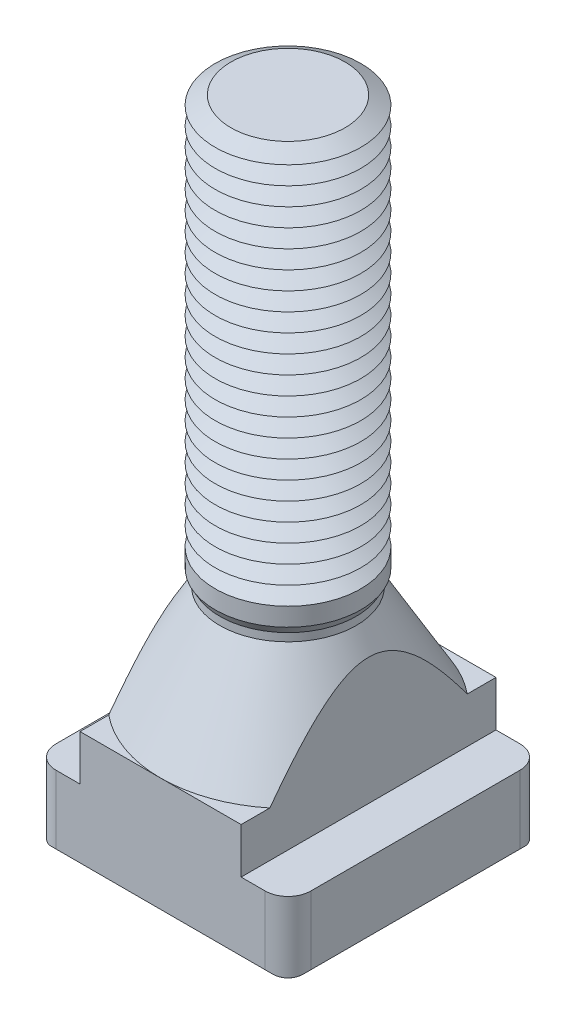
ISO-10303-21;
HEADER;
FILE_DESCRIPTION(('STEP AP214'),'2;1');
FILE_NAME('part.step','',(''),(''),'','','');
FILE_SCHEMA(('AUTOMOTIVE_DESIGN { 1 0 10303 214 1 1 1 1 }'));
ENDSEC;
DATA;
#1=APPLICATION_CONTEXT('core data for automotive mechanical design processes');
#2=APPLICATION_PROTOCOL_DEFINITION('international standard','automotive_design',2000,#1);
#3=PRODUCT_CONTEXT('',#1,'mechanical');
#4=PRODUCT('Part','Part','',(#3));
#5=PRODUCT_RELATED_PRODUCT_CATEGORY('part','',(#4));
#6=PRODUCT_DEFINITION_FORMATION('','',#4);
#7=PRODUCT_DEFINITION_CONTEXT('part definition',#1,'design');
#8=PRODUCT_DEFINITION('design','',#6,#7);
#9=PRODUCT_DEFINITION_SHAPE('','',#8);
#10=(LENGTH_UNIT() NAMED_UNIT(*) SI_UNIT(.MILLI.,.METRE.));
#11=(NAMED_UNIT(*) PLANE_ANGLE_UNIT() SI_UNIT($,.RADIAN.));
#12=(NAMED_UNIT(*) SI_UNIT($,.STERADIAN.) SOLID_ANGLE_UNIT());
#13=UNCERTAINTY_MEASURE_WITH_UNIT(LENGTH_MEASURE(1.E-05),#10,'distance_accuracy_value','');
#14=(GEOMETRIC_REPRESENTATION_CONTEXT(3) GLOBAL_UNCERTAINTY_ASSIGNED_CONTEXT((#13)) GLOBAL_UNIT_ASSIGNED_CONTEXT((#10,
#11,#12)) REPRESENTATION_CONTEXT('',''));
#15=CARTESIAN_POINT('',(0.,0.,0.));
#16=DIRECTION('',(0.,0.,1.));
#17=DIRECTION('',(1.,0.,0.));
#18=AXIS2_PLACEMENT_3D('',#15,#16,#17);
#19=CARTESIAN_POINT('',(0.,65.,0.));
#20=DIRECTION('',(0.,-1.,0.));
#21=DIRECTION('',(0.,0.,-1.));
#22=AXIS2_PLACEMENT_3D('',#19,#20,#21);
#23=CONICAL_SURFACE('',#22,6.26794919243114,1.0471975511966);
#24=CARTESIAN_POINT('',(0.,64.,0.));
#25=DIRECTION('',(0.,-1.,0.));
#26=DIRECTION('',(0.,0.,-1.));
#27=AXIS2_PLACEMENT_3D('',#24,#25,#26);
#28=CIRCLE('',#27,8.00000000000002);
#29=CARTESIAN_POINT('',(0.,64.,-8.00000000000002));
#30=VERTEX_POINT('',#29);
#31=EDGE_CURVE('E633',#30,#30,#28,.T.);
#32=ORIENTED_EDGE('',*,*,#31,.F.);
#33=EDGE_LOOP('',(#32));
#34=FACE_BOUND('',#33,.T.);
#35=CARTESIAN_POINT('',(0.,65.,0.));
#36=DIRECTION('',(0.,-1.,0.));
#37=DIRECTION('',(0.,0.,-1.));
#38=AXIS2_PLACEMENT_3D('',#35,#36,#37);
#39=CIRCLE('',#38,6.26794919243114);
#40=CARTESIAN_POINT('',(0.,65.,-6.26794919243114));
#41=VERTEX_POINT('',#40);
#42=EDGE_CURVE('E636',#41,#41,#39,.T.);
#43=ORIENTED_EDGE('',*,*,#42,.T.);
#44=EDGE_LOOP('',(#43));
#45=FACE_BOUND('',#44,.T.);
#46=ADVANCED_FACE('F39',(#34,#45),#23,.T.);
#47=CARTESIAN_POINT('',(0.,66.,0.));
#48=DIRECTION('',(0.,1.,0.));
#49=DIRECTION('',(0.,0.,1.));
#50=AXIS2_PLACEMENT_3D('',#47,#48,#49);
#51=CONICAL_SURFACE('',#50,8.00000000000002,1.0471975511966);
#52=ORIENTED_EDGE('',*,*,#42,.F.);
#53=EDGE_LOOP('',(#52));
#54=FACE_BOUND('',#53,.T.);
#55=CARTESIAN_POINT('',(0.,66.,0.));
#56=DIRECTION('',(0.,-1.,0.));
#57=DIRECTION('',(0.,0.,-1.));
#58=AXIS2_PLACEMENT_3D('',#55,#56,#57);
#59=CIRCLE('',#58,8.00000000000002);
#60=CARTESIAN_POINT('',(0.,66.,-8.00000000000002));
#61=VERTEX_POINT('',#60);
#62=EDGE_CURVE('E789',#61,#61,#59,.T.);
#63=ORIENTED_EDGE('',*,*,#62,.T.);
#64=EDGE_LOOP('',(#63));
#65=FACE_BOUND('',#64,.T.);
#66=ADVANCED_FACE('F448',(#54,#65),#51,.T.);
#67=CARTESIAN_POINT('',(3.63435455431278,73.,0.));
#68=DIRECTION('',(0.,-1.,0.));
#69=DIRECTION('',(1.,0.,0.));
#70=AXIS2_PLACEMENT_3D('',#67,#68,#69);
#71=PLANE('',#70);
#72=CARTESIAN_POINT('',(0.,73.,0.));
#73=DIRECTION('',(0.,-1.,0.));
#74=DIRECTION('',(0.,0.,-1.));
#75=AXIS2_PLACEMENT_3D('',#72,#73,#74);
#76=CIRCLE('',#75,6.26794919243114);
#77=CARTESIAN_POINT('',(0.,73.,-6.26794919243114));
#78=VERTEX_POINT('',#77);
#79=EDGE_CURVE('E654',#78,#78,#76,.T.);
#80=ORIENTED_EDGE('',*,*,#79,.F.);
#81=EDGE_LOOP('',(#80));
#82=FACE_BOUND('',#81,.T.);
#83=ADVANCED_FACE('F454',(#82),#71,.F.);
#84=CARTESIAN_POINT('',(0.,73.,0.));
#85=DIRECTION('',(0.,-1.,0.));
#86=DIRECTION('',(0.,0.,-1.));
#87=AXIS2_PLACEMENT_3D('',#84,#85,#86);
#88=CONICAL_SURFACE('',#87,6.26794919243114,1.0471975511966);
#89=CARTESIAN_POINT('',(0.,72.,0.));
#90=DIRECTION('',(0.,-1.,0.));
#91=DIRECTION('',(0.,0.,-1.));
#92=AXIS2_PLACEMENT_3D('',#89,#90,#91);
#93=CIRCLE('',#92,8.00000000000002);
#94=CARTESIAN_POINT('',(0.,72.,-8.00000000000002));
#95=VERTEX_POINT('',#94);
#96=EDGE_CURVE('E651',#95,#95,#93,.T.);
#97=ORIENTED_EDGE('',*,*,#96,.F.);
#98=EDGE_LOOP('',(#97));
#99=FACE_BOUND('',#98,.T.);
#100=ORIENTED_EDGE('',*,*,#79,.T.);
#101=EDGE_LOOP('',(#100));
#102=FACE_BOUND('',#101,.T.);
#103=ADVANCED_FACE('F482',(#99,#102),#88,.T.);
#104=CARTESIAN_POINT('',(0.,72.,0.));
#105=DIRECTION('',(0.,1.,0.));
#106=DIRECTION('',(0.,0.,1.));
#107=AXIS2_PLACEMENT_3D('',#104,#105,#106);
#108=CONICAL_SURFACE('',#107,8.00000000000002,1.0471975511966);
#109=CARTESIAN_POINT('',(0.,71.,0.));
#110=DIRECTION('',(0.,-1.,0.));
#111=DIRECTION('',(0.,0.,-1.));
#112=AXIS2_PLACEMENT_3D('',#109,#110,#111);
#113=CIRCLE('',#112,6.26794919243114);
#114=CARTESIAN_POINT('',(0.,71.,-6.26794919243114));
#115=VERTEX_POINT('',#114);
#116=EDGE_CURVE('E655',#115,#115,#113,.T.);
#117=ORIENTED_EDGE('',*,*,#116,.F.);
#118=EDGE_LOOP('',(#117));
#119=FACE_BOUND('',#118,.T.);
#120=ORIENTED_EDGE('',*,*,#96,.T.);
#121=EDGE_LOOP('',(#120));
#122=FACE_BOUND('',#121,.T.);
#123=ADVANCED_FACE('F479',(#119,#122),#108,.T.);
#124=CARTESIAN_POINT('',(0.,71.,0.));
#125=DIRECTION('',(0.,-1.,0.));
#126=DIRECTION('',(0.,0.,-1.));
#127=AXIS2_PLACEMENT_3D('',#124,#125,#126);
#128=CONICAL_SURFACE('',#127,6.26794919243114,1.0471975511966);
#129=CARTESIAN_POINT('',(0.,70.,0.));
#130=DIRECTION('',(0.,-1.,0.));
#131=DIRECTION('',(0.,0.,-1.));
#132=AXIS2_PLACEMENT_3D('',#129,#130,#131);
#133=CIRCLE('',#132,8.00000000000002);
#134=CARTESIAN_POINT('',(0.,70.,-8.00000000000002));
#135=VERTEX_POINT('',#134);
#136=EDGE_CURVE('E659',#135,#135,#133,.T.);
#137=ORIENTED_EDGE('',*,*,#136,.F.);
#138=EDGE_LOOP('',(#137));
#139=FACE_BOUND('',#138,.T.);
#140=ORIENTED_EDGE('',*,*,#116,.T.);
#141=EDGE_LOOP('',(#140));
#142=FACE_BOUND('',#141,.T.);
#143=ADVANCED_FACE('F474',(#139,#142),#128,.T.);
#144=CARTESIAN_POINT('',(0.,70.,0.));
#145=DIRECTION('',(0.,1.,0.));
#146=DIRECTION('',(0.,0.,1.));
#147=AXIS2_PLACEMENT_3D('',#144,#145,#146);
#148=CONICAL_SURFACE('',#147,8.00000000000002,1.0471975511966);
#149=CARTESIAN_POINT('',(0.,69.,0.));
#150=DIRECTION('',(0.,-1.,0.));
#151=DIRECTION('',(0.,0.,-1.));
#152=AXIS2_PLACEMENT_3D('',#149,#150,#151);
#153=CIRCLE('',#152,6.26794919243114);
#154=CARTESIAN_POINT('',(0.,69.,-6.26794919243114));
#155=VERTEX_POINT('',#154);
#156=EDGE_CURVE('E801',#155,#155,#153,.T.);
#157=ORIENTED_EDGE('',*,*,#156,.F.);
#158=EDGE_LOOP('',(#157));
#159=FACE_BOUND('',#158,.T.);
#160=ORIENTED_EDGE('',*,*,#136,.T.);
#161=EDGE_LOOP('',(#160));
#162=FACE_BOUND('',#161,.T.);
#163=ADVANCED_FACE('F471',(#159,#162),#148,.T.);
#164=CARTESIAN_POINT('',(0.,69.,0.));
#165=DIRECTION('',(0.,-1.,0.));
#166=DIRECTION('',(0.,0.,-1.));
#167=AXIS2_PLACEMENT_3D('',#164,#165,#166);
#168=CONICAL_SURFACE('',#167,6.26794919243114,1.0471975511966);
#169=CARTESIAN_POINT('',(0.,68.,0.));
#170=DIRECTION('',(0.,-1.,0.));
#171=DIRECTION('',(0.,0.,-1.));
#172=AXIS2_PLACEMENT_3D('',#169,#170,#171);
#173=CIRCLE('',#172,8.00000000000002);
#174=CARTESIAN_POINT('',(0.,68.,-8.00000000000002));
#175=VERTEX_POINT('',#174);
#176=EDGE_CURVE('E797',#175,#175,#173,.T.);
#177=ORIENTED_EDGE('',*,*,#176,.F.);
#178=EDGE_LOOP('',(#177));
#179=FACE_BOUND('',#178,.T.);
#180=ORIENTED_EDGE('',*,*,#156,.T.);
#181=EDGE_LOOP('',(#180));
#182=FACE_BOUND('',#181,.T.);
#183=ADVANCED_FACE('F465',(#179,#182),#168,.T.);
#184=CARTESIAN_POINT('',(0.,68.,0.));
#185=DIRECTION('',(0.,1.,0.));
#186=DIRECTION('',(0.,0.,1.));
#187=AXIS2_PLACEMENT_3D('',#184,#185,#186);
#188=CONICAL_SURFACE('',#187,8.00000000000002,1.0471975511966);
#189=CARTESIAN_POINT('',(0.,67.,0.));
#190=DIRECTION('',(0.,-1.,0.));
#191=DIRECTION('',(0.,0.,-1.));
#192=AXIS2_PLACEMENT_3D('',#189,#190,#191);
#193=CIRCLE('',#192,6.26794919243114);
#194=CARTESIAN_POINT('',(0.,67.,-6.26794919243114));
#195=VERTEX_POINT('',#194);
#196=EDGE_CURVE('E793',#195,#195,#193,.T.);
#197=ORIENTED_EDGE('',*,*,#196,.F.);
#198=EDGE_LOOP('',(#197));
#199=FACE_BOUND('',#198,.T.);
#200=ORIENTED_EDGE('',*,*,#176,.T.);
#201=EDGE_LOOP('',(#200));
#202=FACE_BOUND('',#201,.T.);
#203=ADVANCED_FACE('F461',(#199,#202),#188,.T.);
#204=CARTESIAN_POINT('',(0.,67.,0.));
#205=DIRECTION('',(0.,-1.,0.));
#206=DIRECTION('',(0.,0.,-1.));
#207=AXIS2_PLACEMENT_3D('',#204,#205,#206);
#208=CONICAL_SURFACE('',#207,6.26794919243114,1.0471975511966);
#209=ORIENTED_EDGE('',*,*,#62,.F.);
#210=EDGE_LOOP('',(#209));
#211=FACE_BOUND('',#210,.T.);
#212=ORIENTED_EDGE('',*,*,#196,.T.);
#213=EDGE_LOOP('',(#212));
#214=FACE_BOUND('',#213,.T.);
#215=ADVANCED_FACE('F464',(#211,#214),#208,.T.);
#216=CARTESIAN_POINT('',(0.,63.,0.));
#217=DIRECTION('',(0.,-1.,0.));
#218=DIRECTION('',(0.,0.,-1.));
#219=AXIS2_PLACEMENT_3D('',#216,#217,#218);
#220=CONICAL_SURFACE('',#219,6.26794919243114,1.0471975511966);
#221=CARTESIAN_POINT('',(0.,62.,0.));
#222=DIRECTION('',(0.,-1.,0.));
#223=DIRECTION('',(0.,0.,-1.));
#224=AXIS2_PLACEMENT_3D('',#221,#222,#223);
#225=CIRCLE('',#224,8.00000000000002);
#226=CARTESIAN_POINT('',(0.,62.,-8.00000000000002));
#227=VERTEX_POINT('',#226);
#228=EDGE_CURVE('E674',#227,#227,#225,.T.);
#229=ORIENTED_EDGE('',*,*,#228,.F.);
#230=EDGE_LOOP('',(#229));
#231=FACE_BOUND('',#230,.T.);
#232=CARTESIAN_POINT('',(0.,63.,0.));
#233=DIRECTION('',(0.,-1.,0.));
#234=DIRECTION('',(0.,0.,-1.));
#235=AXIS2_PLACEMENT_3D('',#232,#233,#234);
#236=CIRCLE('',#235,6.26794919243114);
#237=CARTESIAN_POINT('',(0.,63.,-6.26794919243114));
#238=VERTEX_POINT('',#237);
#239=EDGE_CURVE('E637',#238,#238,#236,.T.);
#240=ORIENTED_EDGE('',*,*,#239,.T.);
#241=EDGE_LOOP('',(#240));
#242=FACE_BOUND('',#241,.T.);
#243=ADVANCED_FACE('F469',(#231,#242),#220,.T.);
#244=CARTESIAN_POINT('',(0.,64.,0.));
#245=DIRECTION('',(0.,1.,0.));
#246=DIRECTION('',(0.,0.,1.));
#247=AXIS2_PLACEMENT_3D('',#244,#245,#246);
#248=CONICAL_SURFACE('',#247,8.00000000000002,1.0471975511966);
#249=ORIENTED_EDGE('',*,*,#239,.F.);
#250=EDGE_LOOP('',(#249));
#251=FACE_BOUND('',#250,.T.);
#252=ORIENTED_EDGE('',*,*,#31,.T.);
#253=EDGE_LOOP('',(#252));
#254=FACE_BOUND('',#253,.T.);
#255=ADVANCED_FACE('F1270',(#251,#254),#248,.T.);
#256=CARTESIAN_POINT('',(0.,61.,0.));
#257=DIRECTION('',(0.,-1.,0.));
#258=DIRECTION('',(0.,0.,-1.));
#259=AXIS2_PLACEMENT_3D('',#256,#257,#258);
#260=CONICAL_SURFACE('',#259,6.26794919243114,1.0471975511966);
#261=CARTESIAN_POINT('',(0.,60.,0.));
#262=DIRECTION('',(0.,-1.,0.));
#263=DIRECTION('',(0.,0.,-1.));
#264=AXIS2_PLACEMENT_3D('',#261,#262,#263);
#265=CIRCLE('',#264,8.00000000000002);
#266=CARTESIAN_POINT('',(0.,60.,-8.00000000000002));
#267=VERTEX_POINT('',#266);
#268=EDGE_CURVE('E675',#267,#267,#265,.T.);
#269=ORIENTED_EDGE('',*,*,#268,.F.);
#270=EDGE_LOOP('',(#269));
#271=FACE_BOUND('',#270,.T.);
#272=CARTESIAN_POINT('',(0.,61.,0.));
#273=DIRECTION('',(0.,-1.,0.));
#274=DIRECTION('',(0.,0.,-1.));
#275=AXIS2_PLACEMENT_3D('',#272,#273,#274);
#276=CIRCLE('',#275,6.26794919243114);
#277=CARTESIAN_POINT('',(0.,61.,-6.26794919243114));
#278=VERTEX_POINT('',#277);
#279=EDGE_CURVE('E671',#278,#278,#276,.T.);
#280=ORIENTED_EDGE('',*,*,#279,.T.);
#281=EDGE_LOOP('',(#280));
#282=FACE_BOUND('',#281,.T.);
#283=ADVANCED_FACE('F1260',(#271,#282),#260,.T.);
#284=CARTESIAN_POINT('',(0.,62.,0.));
#285=DIRECTION('',(0.,1.,0.));
#286=DIRECTION('',(0.,0.,1.));
#287=AXIS2_PLACEMENT_3D('',#284,#285,#286);
#288=CONICAL_SURFACE('',#287,8.00000000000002,1.0471975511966);
#289=ORIENTED_EDGE('',*,*,#279,.F.);
#290=EDGE_LOOP('',(#289));
#291=FACE_BOUND('',#290,.T.);
#292=ORIENTED_EDGE('',*,*,#228,.T.);
#293=EDGE_LOOP('',(#292));
#294=FACE_BOUND('',#293,.T.);
#295=ADVANCED_FACE('F1250',(#291,#294),#288,.T.);
#296=CARTESIAN_POINT('',(0.,59.,0.));
#297=DIRECTION('',(0.,-1.,0.));
#298=DIRECTION('',(0.,0.,-1.));
#299=AXIS2_PLACEMENT_3D('',#296,#297,#298);
#300=CONICAL_SURFACE('',#299,6.26794919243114,1.0471975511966);
#301=CARTESIAN_POINT('',(0.,58.,0.));
#302=DIRECTION('',(0.,-1.,0.));
#303=DIRECTION('',(0.,0.,-1.));
#304=AXIS2_PLACEMENT_3D('',#301,#302,#303);
#305=CIRCLE('',#304,8.00000000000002);
#306=CARTESIAN_POINT('',(0.,58.,-8.00000000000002));
#307=VERTEX_POINT('',#306);
#308=EDGE_CURVE('E639',#307,#307,#305,.T.);
#309=ORIENTED_EDGE('',*,*,#308,.F.);
#310=EDGE_LOOP('',(#309));
#311=FACE_BOUND('',#310,.T.);
#312=CARTESIAN_POINT('',(0.,59.,0.));
#313=DIRECTION('',(0.,-1.,0.));
#314=DIRECTION('',(0.,0.,-1.));
#315=AXIS2_PLACEMENT_3D('',#312,#313,#314);
#316=CIRCLE('',#315,6.26794919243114);
#317=CARTESIAN_POINT('',(0.,59.,-6.26794919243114));
#318=VERTEX_POINT('',#317);
#319=EDGE_CURVE('E642',#318,#318,#316,.T.);
#320=ORIENTED_EDGE('',*,*,#319,.T.);
#321=EDGE_LOOP('',(#320));
#322=FACE_BOUND('',#321,.T.);
#323=ADVANCED_FACE('F1240',(#311,#322),#300,.T.);
#324=CARTESIAN_POINT('',(0.,60.,0.));
#325=DIRECTION('',(0.,1.,0.));
#326=DIRECTION('',(0.,0.,1.));
#327=AXIS2_PLACEMENT_3D('',#324,#325,#326);
#328=CONICAL_SURFACE('',#327,8.00000000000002,1.0471975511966);
#329=ORIENTED_EDGE('',*,*,#319,.F.);
#330=EDGE_LOOP('',(#329));
#331=FACE_BOUND('',#330,.T.);
#332=ORIENTED_EDGE('',*,*,#268,.T.);
#333=EDGE_LOOP('',(#332));
#334=FACE_BOUND('',#333,.T.);
#335=ADVANCED_FACE('F1230',(#331,#334),#328,.T.);
#336=CARTESIAN_POINT('',(0.,57.,0.));
#337=DIRECTION('',(0.,-1.,0.));
#338=DIRECTION('',(0.,0.,-1.));
#339=AXIS2_PLACEMENT_3D('',#336,#337,#338);
#340=CONICAL_SURFACE('',#339,6.26794919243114,1.0471975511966);
#341=CARTESIAN_POINT('',(0.,56.,0.));
#342=DIRECTION('',(0.,-1.,0.));
#343=DIRECTION('',(0.,0.,-1.));
#344=AXIS2_PLACEMENT_3D('',#341,#342,#343);
#345=CIRCLE('',#344,8.00000000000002);
#346=CARTESIAN_POINT('',(0.,56.,-8.00000000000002));
#347=VERTEX_POINT('',#346);
#348=EDGE_CURVE('E767',#347,#347,#345,.T.);
#349=ORIENTED_EDGE('',*,*,#348,.F.);
#350=EDGE_LOOP('',(#349));
#351=FACE_BOUND('',#350,.T.);
#352=CARTESIAN_POINT('',(0.,57.,0.));
#353=DIRECTION('',(0.,-1.,0.));
#354=DIRECTION('',(0.,0.,-1.));
#355=AXIS2_PLACEMENT_3D('',#352,#353,#354);
#356=CIRCLE('',#355,6.26794919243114);
#357=CARTESIAN_POINT('',(0.,57.,-6.26794919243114));
#358=VERTEX_POINT('',#357);
#359=EDGE_CURVE('E643',#358,#358,#356,.T.);
#360=ORIENTED_EDGE('',*,*,#359,.T.);
#361=EDGE_LOOP('',(#360));
#362=FACE_BOUND('',#361,.T.);
#363=ADVANCED_FACE('F1220',(#351,#362),#340,.T.);
#364=CARTESIAN_POINT('',(0.,58.,0.));
#365=DIRECTION('',(0.,1.,0.));
#366=DIRECTION('',(0.,0.,1.));
#367=AXIS2_PLACEMENT_3D('',#364,#365,#366);
#368=CONICAL_SURFACE('',#367,8.00000000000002,1.0471975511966);
#369=ORIENTED_EDGE('',*,*,#359,.F.);
#370=EDGE_LOOP('',(#369));
#371=FACE_BOUND('',#370,.T.);
#372=ORIENTED_EDGE('',*,*,#308,.T.);
#373=EDGE_LOOP('',(#372));
#374=FACE_BOUND('',#373,.T.);
#375=ADVANCED_FACE('F1210',(#371,#374),#368,.T.);
#376=CARTESIAN_POINT('',(0.,55.,0.));
#377=DIRECTION('',(0.,-1.,0.));
#378=DIRECTION('',(0.,0.,-1.));
#379=AXIS2_PLACEMENT_3D('',#376,#377,#378);
#380=CONICAL_SURFACE('',#379,6.26794919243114,1.0471975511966);
#381=CARTESIAN_POINT('',(0.,54.,0.));
#382=DIRECTION('',(0.,-1.,0.));
#383=DIRECTION('',(0.,0.,-1.));
#384=AXIS2_PLACEMENT_3D('',#381,#382,#383);
#385=CIRCLE('',#384,8.00000000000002);
#386=CARTESIAN_POINT('',(0.,54.,-8.00000000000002));
#387=VERTEX_POINT('',#386);
#388=EDGE_CURVE('E677',#387,#387,#385,.T.);
#389=ORIENTED_EDGE('',*,*,#388,.F.);
#390=EDGE_LOOP('',(#389));
#391=FACE_BOUND('',#390,.T.);
#392=CARTESIAN_POINT('',(0.,55.,0.));
#393=DIRECTION('',(0.,-1.,0.));
#394=DIRECTION('',(0.,0.,-1.));
#395=AXIS2_PLACEMENT_3D('',#392,#393,#394);
#396=CIRCLE('',#395,6.26794919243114);
#397=CARTESIAN_POINT('',(0.,55.,-6.26794919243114));
#398=VERTEX_POINT('',#397);
#399=EDGE_CURVE('E680',#398,#398,#396,.T.);
#400=ORIENTED_EDGE('',*,*,#399,.T.);
#401=EDGE_LOOP('',(#400));
#402=FACE_BOUND('',#401,.T.);
#403=ADVANCED_FACE('F1200',(#391,#402),#380,.T.);
#404=CARTESIAN_POINT('',(0.,56.,0.));
#405=DIRECTION('',(0.,1.,0.));
#406=DIRECTION('',(0.,0.,1.));
#407=AXIS2_PLACEMENT_3D('',#404,#405,#406);
#408=CONICAL_SURFACE('',#407,8.00000000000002,1.0471975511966);
#409=ORIENTED_EDGE('',*,*,#399,.F.);
#410=EDGE_LOOP('',(#409));
#411=FACE_BOUND('',#410,.T.);
#412=ORIENTED_EDGE('',*,*,#348,.T.);
#413=EDGE_LOOP('',(#412));
#414=FACE_BOUND('',#413,.T.);
#415=ADVANCED_FACE('F1190',(#411,#414),#408,.T.);
#416=CARTESIAN_POINT('',(0.,53.,0.));
#417=DIRECTION('',(0.,-1.,0.));
#418=DIRECTION('',(0.,0.,-1.));
#419=AXIS2_PLACEMENT_3D('',#416,#417,#418);
#420=CONICAL_SURFACE('',#419,6.26794919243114,1.0471975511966);
#421=CARTESIAN_POINT('',(0.,52.,0.));
#422=DIRECTION('',(0.,-1.,0.));
#423=DIRECTION('',(0.,0.,-1.));
#424=AXIS2_PLACEMENT_3D('',#421,#422,#423);
#425=CIRCLE('',#424,8.00000000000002);
#426=CARTESIAN_POINT('',(0.,52.,-8.00000000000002));
#427=VERTEX_POINT('',#426);
#428=EDGE_CURVE('E683',#427,#427,#425,.T.);
#429=ORIENTED_EDGE('',*,*,#428,.F.);
#430=EDGE_LOOP('',(#429));
#431=FACE_BOUND('',#430,.T.);
#432=CARTESIAN_POINT('',(0.,53.,0.));
#433=DIRECTION('',(0.,-1.,0.));
#434=DIRECTION('',(0.,0.,-1.));
#435=AXIS2_PLACEMENT_3D('',#432,#433,#434);
#436=CIRCLE('',#435,6.26794919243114);
#437=CARTESIAN_POINT('',(0.,53.,-6.26794919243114));
#438=VERTEX_POINT('',#437);
#439=EDGE_CURVE('E681',#438,#438,#436,.T.);
#440=ORIENTED_EDGE('',*,*,#439,.T.);
#441=EDGE_LOOP('',(#440));
#442=FACE_BOUND('',#441,.T.);
#443=ADVANCED_FACE('F1180',(#431,#442),#420,.T.);
#444=CARTESIAN_POINT('',(0.,54.,0.));
#445=DIRECTION('',(0.,1.,0.));
#446=DIRECTION('',(0.,0.,1.));
#447=AXIS2_PLACEMENT_3D('',#444,#445,#446);
#448=CONICAL_SURFACE('',#447,8.00000000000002,1.0471975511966);
#449=ORIENTED_EDGE('',*,*,#439,.F.);
#450=EDGE_LOOP('',(#449));
#451=FACE_BOUND('',#450,.T.);
#452=ORIENTED_EDGE('',*,*,#388,.T.);
#453=EDGE_LOOP('',(#452));
#454=FACE_BOUND('',#453,.T.);
#455=ADVANCED_FACE('F1170',(#451,#454),#448,.T.);
#456=CARTESIAN_POINT('',(0.,51.,0.));
#457=DIRECTION('',(0.,-1.,0.));
#458=DIRECTION('',(0.,0.,-1.));
#459=AXIS2_PLACEMENT_3D('',#456,#457,#458);
#460=CONICAL_SURFACE('',#459,6.26794919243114,1.0471975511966);
#461=CARTESIAN_POINT('',(0.,50.,0.));
#462=DIRECTION('',(0.,-1.,0.));
#463=DIRECTION('',(0.,0.,-1.));
#464=AXIS2_PLACEMENT_3D('',#461,#462,#463);
#465=CIRCLE('',#464,8.00000000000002);
#466=CARTESIAN_POINT('',(0.,50.,-8.00000000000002));
#467=VERTEX_POINT('',#466);
#468=EDGE_CURVE('E754',#467,#467,#465,.T.);
#469=ORIENTED_EDGE('',*,*,#468,.F.);
#470=EDGE_LOOP('',(#469));
#471=FACE_BOUND('',#470,.T.);
#472=CARTESIAN_POINT('',(0.,51.,0.));
#473=DIRECTION('',(0.,-1.,0.));
#474=DIRECTION('',(0.,0.,-1.));
#475=AXIS2_PLACEMENT_3D('',#472,#473,#474);
#476=CIRCLE('',#475,6.26794919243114);
#477=CARTESIAN_POINT('',(0.,51.,-6.26794919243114));
#478=VERTEX_POINT('',#477);
#479=EDGE_CURVE('E686',#478,#478,#476,.T.);
#480=ORIENTED_EDGE('',*,*,#479,.T.);
#481=EDGE_LOOP('',(#480));
#482=FACE_BOUND('',#481,.T.);
#483=ADVANCED_FACE('F1160',(#471,#482),#460,.T.);
#484=CARTESIAN_POINT('',(0.,52.,0.));
#485=DIRECTION('',(0.,1.,0.));
#486=DIRECTION('',(0.,0.,1.));
#487=AXIS2_PLACEMENT_3D('',#484,#485,#486);
#488=CONICAL_SURFACE('',#487,8.00000000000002,1.0471975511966);
#489=ORIENTED_EDGE('',*,*,#479,.F.);
#490=EDGE_LOOP('',(#489));
#491=FACE_BOUND('',#490,.T.);
#492=ORIENTED_EDGE('',*,*,#428,.T.);
#493=EDGE_LOOP('',(#492));
#494=FACE_BOUND('',#493,.T.);
#495=ADVANCED_FACE('F1150',(#491,#494),#488,.T.);
#496=CARTESIAN_POINT('',(0.,49.,0.));
#497=DIRECTION('',(0.,-1.,0.));
#498=DIRECTION('',(0.,0.,-1.));
#499=AXIS2_PLACEMENT_3D('',#496,#497,#498);
#500=CONICAL_SURFACE('',#499,6.26794919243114,1.0471975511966);
#501=CARTESIAN_POINT('',(0.,48.,0.));
#502=DIRECTION('',(0.,-1.,0.));
#503=DIRECTION('',(0.,0.,-1.));
#504=AXIS2_PLACEMENT_3D('',#501,#502,#503);
#505=CIRCLE('',#504,8.00000000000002);
#506=CARTESIAN_POINT('',(0.,48.,-8.00000000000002));
#507=VERTEX_POINT('',#506);
#508=EDGE_CURVE('E747',#507,#507,#505,.T.);
#509=ORIENTED_EDGE('',*,*,#508,.F.);
#510=EDGE_LOOP('',(#509));
#511=FACE_BOUND('',#510,.T.);
#512=CARTESIAN_POINT('',(0.,49.,0.));
#513=DIRECTION('',(0.,-1.,0.));
#514=DIRECTION('',(0.,0.,-1.));
#515=AXIS2_PLACEMENT_3D('',#512,#513,#514);
#516=CIRCLE('',#515,6.26794919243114);
#517=CARTESIAN_POINT('',(0.,49.,-6.26794919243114));
#518=VERTEX_POINT('',#517);
#519=EDGE_CURVE('E750',#518,#518,#516,.T.);
#520=ORIENTED_EDGE('',*,*,#519,.T.);
#521=EDGE_LOOP('',(#520));
#522=FACE_BOUND('',#521,.T.);
#523=ADVANCED_FACE('F1140',(#511,#522),#500,.T.);
#524=CARTESIAN_POINT('',(0.,50.,0.));
#525=DIRECTION('',(0.,1.,0.));
#526=DIRECTION('',(0.,0.,1.));
#527=AXIS2_PLACEMENT_3D('',#524,#525,#526);
#528=CONICAL_SURFACE('',#527,8.00000000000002,1.0471975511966);
#529=ORIENTED_EDGE('',*,*,#519,.F.);
#530=EDGE_LOOP('',(#529));
#531=FACE_BOUND('',#530,.T.);
#532=ORIENTED_EDGE('',*,*,#468,.T.);
#533=EDGE_LOOP('',(#532));
#534=FACE_BOUND('',#533,.T.);
#535=ADVANCED_FACE('F1130',(#531,#534),#528,.T.);
#536=CARTESIAN_POINT('',(0.,47.,0.));
#537=DIRECTION('',(0.,-1.,0.));
#538=DIRECTION('',(0.,0.,-1.));
#539=AXIS2_PLACEMENT_3D('',#536,#537,#538);
#540=CONICAL_SURFACE('',#539,6.26794919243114,1.0471975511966);
#541=CARTESIAN_POINT('',(0.,46.,0.));
#542=DIRECTION('',(0.,-1.,0.));
#543=DIRECTION('',(0.,0.,-1.));
#544=AXIS2_PLACEMENT_3D('',#541,#542,#543);
#545=CIRCLE('',#544,8.00000000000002);
#546=CARTESIAN_POINT('',(0.,46.,-8.00000000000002));
#547=VERTEX_POINT('',#546);
#548=EDGE_CURVE('E663',#547,#547,#545,.T.);
#549=ORIENTED_EDGE('',*,*,#548,.F.);
#550=EDGE_LOOP('',(#549));
#551=FACE_BOUND('',#550,.T.);
#552=CARTESIAN_POINT('',(0.,47.,0.));
#553=DIRECTION('',(0.,-1.,0.));
#554=DIRECTION('',(0.,0.,-1.));
#555=AXIS2_PLACEMENT_3D('',#552,#553,#554);
#556=CIRCLE('',#555,6.26794919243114);
#557=CARTESIAN_POINT('',(0.,47.,-6.26794919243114));
#558=VERTEX_POINT('',#557);
#559=EDGE_CURVE('E743',#558,#558,#556,.T.);
#560=ORIENTED_EDGE('',*,*,#559,.T.);
#561=EDGE_LOOP('',(#560));
#562=FACE_BOUND('',#561,.T.);
#563=ADVANCED_FACE('F1120',(#551,#562),#540,.T.);
#564=CARTESIAN_POINT('',(0.,48.,0.));
#565=DIRECTION('',(0.,1.,0.));
#566=DIRECTION('',(0.,0.,1.));
#567=AXIS2_PLACEMENT_3D('',#564,#565,#566);
#568=CONICAL_SURFACE('',#567,8.00000000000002,1.0471975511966);
#569=ORIENTED_EDGE('',*,*,#559,.F.);
#570=EDGE_LOOP('',(#569));
#571=FACE_BOUND('',#570,.T.);
#572=ORIENTED_EDGE('',*,*,#508,.T.);
#573=EDGE_LOOP('',(#572));
#574=FACE_BOUND('',#573,.T.);
#575=ADVANCED_FACE('F1110',(#571,#574),#568,.T.);
#576=CARTESIAN_POINT('',(0.,45.,0.));
#577=DIRECTION('',(0.,-1.,0.));
#578=DIRECTION('',(0.,0.,-1.));
#579=AXIS2_PLACEMENT_3D('',#576,#577,#578);
#580=CONICAL_SURFACE('',#579,6.26794919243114,1.0471975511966);
#581=CARTESIAN_POINT('',(0.,44.,0.));
#582=DIRECTION('',(0.,-1.,0.));
#583=DIRECTION('',(0.,0.,-1.));
#584=AXIS2_PLACEMENT_3D('',#581,#582,#583);
#585=CIRCLE('',#584,8.00000000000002);
#586=CARTESIAN_POINT('',(0.,44.,-8.00000000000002));
#587=VERTEX_POINT('',#586);
#588=EDGE_CURVE('E664',#587,#587,#585,.T.);
#589=ORIENTED_EDGE('',*,*,#588,.F.);
#590=EDGE_LOOP('',(#589));
#591=FACE_BOUND('',#590,.T.);
#592=CARTESIAN_POINT('',(0.,45.,0.));
#593=DIRECTION('',(0.,-1.,0.));
#594=DIRECTION('',(0.,0.,-1.));
#595=AXIS2_PLACEMENT_3D('',#592,#593,#594);
#596=CIRCLE('',#595,6.26794919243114);
#597=CARTESIAN_POINT('',(0.,45.,-6.26794919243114));
#598=VERTEX_POINT('',#597);
#599=EDGE_CURVE('E661',#598,#598,#596,.T.);
#600=ORIENTED_EDGE('',*,*,#599,.T.);
#601=EDGE_LOOP('',(#600));
#602=FACE_BOUND('',#601,.T.);
#603=ADVANCED_FACE('F1100',(#591,#602),#580,.T.);
#604=CARTESIAN_POINT('',(0.,46.,0.));
#605=DIRECTION('',(0.,1.,0.));
#606=DIRECTION('',(0.,0.,1.));
#607=AXIS2_PLACEMENT_3D('',#604,#605,#606);
#608=CONICAL_SURFACE('',#607,8.00000000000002,1.0471975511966);
#609=ORIENTED_EDGE('',*,*,#599,.F.);
#610=EDGE_LOOP('',(#609));
#611=FACE_BOUND('',#610,.T.);
#612=ORIENTED_EDGE('',*,*,#548,.T.);
#613=EDGE_LOOP('',(#612));
#614=FACE_BOUND('',#613,.T.);
#615=ADVANCED_FACE('F1090',(#611,#614),#608,.T.);
#616=CARTESIAN_POINT('',(0.,43.,0.));
#617=DIRECTION('',(0.,-1.,0.));
#618=DIRECTION('',(0.,0.,-1.));
#619=AXIS2_PLACEMENT_3D('',#616,#617,#618);
#620=CONICAL_SURFACE('',#619,6.26794919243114,1.0471975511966);
#621=CARTESIAN_POINT('',(0.,42.,0.));
#622=DIRECTION('',(0.,-1.,0.));
#623=DIRECTION('',(0.,0.,-1.));
#624=AXIS2_PLACEMENT_3D('',#621,#622,#623);
#625=CIRCLE('',#624,8.00000000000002);
#626=CARTESIAN_POINT('',(0.,42.,-8.00000000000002));
#627=VERTEX_POINT('',#626);
#628=EDGE_CURVE('E729',#627,#627,#625,.T.);
#629=ORIENTED_EDGE('',*,*,#628,.F.);
#630=EDGE_LOOP('',(#629));
#631=FACE_BOUND('',#630,.T.);
#632=CARTESIAN_POINT('',(0.,43.,0.));
#633=DIRECTION('',(0.,-1.,0.));
#634=DIRECTION('',(0.,0.,-1.));
#635=AXIS2_PLACEMENT_3D('',#632,#633,#634);
#636=CIRCLE('',#635,6.26794919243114);
#637=CARTESIAN_POINT('',(0.,43.,-6.26794919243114));
#638=VERTEX_POINT('',#637);
#639=EDGE_CURVE('E733',#638,#638,#636,.T.);
#640=ORIENTED_EDGE('',*,*,#639,.T.);
#641=EDGE_LOOP('',(#640));
#642=FACE_BOUND('',#641,.T.);
#643=ADVANCED_FACE('F1080',(#631,#642),#620,.T.);
#644=CARTESIAN_POINT('',(0.,44.,0.));
#645=DIRECTION('',(0.,1.,0.));
#646=DIRECTION('',(0.,0.,1.));
#647=AXIS2_PLACEMENT_3D('',#644,#645,#646);
#648=CONICAL_SURFACE('',#647,8.00000000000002,1.0471975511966);
#649=ORIENTED_EDGE('',*,*,#639,.F.);
#650=EDGE_LOOP('',(#649));
#651=FACE_BOUND('',#650,.T.);
#652=ORIENTED_EDGE('',*,*,#588,.T.);
#653=EDGE_LOOP('',(#652));
#654=FACE_BOUND('',#653,.T.);
#655=ADVANCED_FACE('F1070',(#651,#654),#648,.T.);
#656=CARTESIAN_POINT('',(0.,41.,0.));
#657=DIRECTION('',(0.,-1.,0.));
#658=DIRECTION('',(0.,0.,-1.));
#659=AXIS2_PLACEMENT_3D('',#656,#657,#658);
#660=CONICAL_SURFACE('',#659,6.26794919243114,1.0471975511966);
#661=CARTESIAN_POINT('',(0.,40.,0.));
#662=DIRECTION('',(0.,-1.,0.));
#663=DIRECTION('',(0.,0.,-1.));
#664=AXIS2_PLACEMENT_3D('',#661,#662,#663);
#665=CIRCLE('',#664,8.00000000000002);
#666=CARTESIAN_POINT('',(0.,40.,-8.00000000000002));
#667=VERTEX_POINT('',#666);
#668=EDGE_CURVE('E721',#667,#667,#665,.T.);
#669=ORIENTED_EDGE('',*,*,#668,.F.);
#670=EDGE_LOOP('',(#669));
#671=FACE_BOUND('',#670,.T.);
#672=CARTESIAN_POINT('',(0.,41.,0.));
#673=DIRECTION('',(0.,-1.,0.));
#674=DIRECTION('',(0.,0.,-1.));
#675=AXIS2_PLACEMENT_3D('',#672,#673,#674);
#676=CIRCLE('',#675,6.26794919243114);
#677=CARTESIAN_POINT('',(0.,41.,-6.26794919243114));
#678=VERTEX_POINT('',#677);
#679=EDGE_CURVE('E725',#678,#678,#676,.T.);
#680=ORIENTED_EDGE('',*,*,#679,.T.);
#681=EDGE_LOOP('',(#680));
#682=FACE_BOUND('',#681,.T.);
#683=ADVANCED_FACE('F1060',(#671,#682),#660,.T.);
#684=CARTESIAN_POINT('',(0.,42.,0.));
#685=DIRECTION('',(0.,1.,0.));
#686=DIRECTION('',(0.,0.,1.));
#687=AXIS2_PLACEMENT_3D('',#684,#685,#686);
#688=CONICAL_SURFACE('',#687,8.00000000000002,1.0471975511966);
#689=ORIENTED_EDGE('',*,*,#679,.F.);
#690=EDGE_LOOP('',(#689));
#691=FACE_BOUND('',#690,.T.);
#692=ORIENTED_EDGE('',*,*,#628,.T.);
#693=EDGE_LOOP('',(#692));
#694=FACE_BOUND('',#693,.T.);
#695=ADVANCED_FACE('F1050',(#691,#694),#688,.T.);
#696=CARTESIAN_POINT('',(0.,39.,0.));
#697=DIRECTION('',(0.,-1.,0.));
#698=DIRECTION('',(0.,0.,-1.));
#699=AXIS2_PLACEMENT_3D('',#696,#697,#698);
#700=CONICAL_SURFACE('',#699,6.26794919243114,1.0471975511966);
#701=CARTESIAN_POINT('',(0.,38.,0.));
#702=DIRECTION('',(0.,-1.,0.));
#703=DIRECTION('',(0.,0.,-1.));
#704=AXIS2_PLACEMENT_3D('',#701,#702,#703);
#705=CIRCLE('',#704,8.00000000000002);
#706=CARTESIAN_POINT('',(0.,38.,-8.00000000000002));
#707=VERTEX_POINT('',#706);
#708=EDGE_CURVE('E713',#707,#707,#705,.T.);
#709=ORIENTED_EDGE('',*,*,#708,.F.);
#710=EDGE_LOOP('',(#709));
#711=FACE_BOUND('',#710,.T.);
#712=CARTESIAN_POINT('',(0.,39.,0.));
#713=DIRECTION('',(0.,-1.,0.));
#714=DIRECTION('',(0.,0.,-1.));
#715=AXIS2_PLACEMENT_3D('',#712,#713,#714);
#716=CIRCLE('',#715,6.26794919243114);
#717=CARTESIAN_POINT('',(0.,39.,-6.26794919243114));
#718=VERTEX_POINT('',#717);
#719=EDGE_CURVE('E717',#718,#718,#716,.T.);
#720=ORIENTED_EDGE('',*,*,#719,.T.);
#721=EDGE_LOOP('',(#720));
#722=FACE_BOUND('',#721,.T.);
#723=ADVANCED_FACE('F1040',(#711,#722),#700,.T.);
#724=CARTESIAN_POINT('',(0.,40.,0.));
#725=DIRECTION('',(0.,1.,0.));
#726=DIRECTION('',(0.,0.,1.));
#727=AXIS2_PLACEMENT_3D('',#724,#725,#726);
#728=CONICAL_SURFACE('',#727,8.00000000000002,1.0471975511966);
#729=ORIENTED_EDGE('',*,*,#719,.F.);
#730=EDGE_LOOP('',(#729));
#731=FACE_BOUND('',#730,.T.);
#732=ORIENTED_EDGE('',*,*,#668,.T.);
#733=EDGE_LOOP('',(#732));
#734=FACE_BOUND('',#733,.T.);
#735=ADVANCED_FACE('F1030',(#731,#734),#728,.T.);
#736=CARTESIAN_POINT('',(0.,37.,0.));
#737=DIRECTION('',(0.,-1.,0.));
#738=DIRECTION('',(0.,0.,-1.));
#739=AXIS2_PLACEMENT_3D('',#736,#737,#738);
#740=CONICAL_SURFACE('',#739,6.26794919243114,1.0471975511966);
#741=CARTESIAN_POINT('',(0.,36.,0.));
#742=DIRECTION('',(0.,-1.,0.));
#743=DIRECTION('',(0.,0.,-1.));
#744=AXIS2_PLACEMENT_3D('',#741,#742,#743);
#745=CIRCLE('',#744,8.00000000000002);
#746=CARTESIAN_POINT('',(0.,36.,-8.00000000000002));
#747=VERTEX_POINT('',#746);
#748=EDGE_CURVE('E705',#747,#747,#745,.T.);
#749=ORIENTED_EDGE('',*,*,#748,.F.);
#750=EDGE_LOOP('',(#749));
#751=FACE_BOUND('',#750,.T.);
#752=CARTESIAN_POINT('',(0.,37.,0.));
#753=DIRECTION('',(0.,-1.,0.));
#754=DIRECTION('',(0.,0.,-1.));
#755=AXIS2_PLACEMENT_3D('',#752,#753,#754);
#756=CIRCLE('',#755,6.26794919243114);
#757=CARTESIAN_POINT('',(0.,37.,-6.26794919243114));
#758=VERTEX_POINT('',#757);
#759=EDGE_CURVE('E709',#758,#758,#756,.T.);
#760=ORIENTED_EDGE('',*,*,#759,.T.);
#761=EDGE_LOOP('',(#760));
#762=FACE_BOUND('',#761,.T.);
#763=ADVANCED_FACE('F1020',(#751,#762),#740,.T.);
#764=CARTESIAN_POINT('',(0.,38.,0.));
#765=DIRECTION('',(0.,1.,0.));
#766=DIRECTION('',(0.,0.,1.));
#767=AXIS2_PLACEMENT_3D('',#764,#765,#766);
#768=CONICAL_SURFACE('',#767,8.00000000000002,1.0471975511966);
#769=ORIENTED_EDGE('',*,*,#759,.F.);
#770=EDGE_LOOP('',(#769));
#771=FACE_BOUND('',#770,.T.);
#772=ORIENTED_EDGE('',*,*,#708,.T.);
#773=EDGE_LOOP('',(#772));
#774=FACE_BOUND('',#773,.T.);
#775=ADVANCED_FACE('F1010',(#771,#774),#768,.T.);
#776=CARTESIAN_POINT('',(0.,35.,0.));
#777=DIRECTION('',(0.,-1.,0.));
#778=DIRECTION('',(0.,0.,-1.));
#779=AXIS2_PLACEMENT_3D('',#776,#777,#778);
#780=CONICAL_SURFACE('',#779,6.26794919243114,1.0471975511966);
#781=CARTESIAN_POINT('',(0.,34.,0.));
#782=DIRECTION('',(0.,-1.,0.));
#783=DIRECTION('',(0.,0.,-1.));
#784=AXIS2_PLACEMENT_3D('',#781,#782,#783);
#785=CIRCLE('',#784,8.00000000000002);
#786=CARTESIAN_POINT('',(0.,34.,-8.00000000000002));
#787=VERTEX_POINT('',#786);
#788=EDGE_CURVE('E645',#787,#787,#785,.T.);
#789=ORIENTED_EDGE('',*,*,#788,.F.);
#790=EDGE_LOOP('',(#789));
#791=FACE_BOUND('',#790,.T.);
#792=CARTESIAN_POINT('',(0.,35.,0.));
#793=DIRECTION('',(0.,-1.,0.));
#794=DIRECTION('',(0.,0.,-1.));
#795=AXIS2_PLACEMENT_3D('',#792,#793,#794);
#796=CIRCLE('',#795,6.26794919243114);
#797=CARTESIAN_POINT('',(0.,35.,-6.26794919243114));
#798=VERTEX_POINT('',#797);
#799=EDGE_CURVE('E647',#798,#798,#796,.T.);
#800=ORIENTED_EDGE('',*,*,#799,.T.);
#801=EDGE_LOOP('',(#800));
#802=FACE_BOUND('',#801,.T.);
#803=ADVANCED_FACE('F1000',(#791,#802),#780,.T.);
#804=CARTESIAN_POINT('',(0.,36.,0.));
#805=DIRECTION('',(0.,1.,0.));
#806=DIRECTION('',(0.,0.,1.));
#807=AXIS2_PLACEMENT_3D('',#804,#805,#806);
#808=CONICAL_SURFACE('',#807,8.00000000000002,1.0471975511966);
#809=ORIENTED_EDGE('',*,*,#799,.F.);
#810=EDGE_LOOP('',(#809));
#811=FACE_BOUND('',#810,.T.);
#812=ORIENTED_EDGE('',*,*,#748,.T.);
#813=EDGE_LOOP('',(#812));
#814=FACE_BOUND('',#813,.T.);
#815=ADVANCED_FACE('F990',(#811,#814),#808,.T.);
#816=CARTESIAN_POINT('',(0.,33.,0.));
#817=DIRECTION('',(0.,-1.,0.));
#818=DIRECTION('',(0.,0.,-1.));
#819=AXIS2_PLACEMENT_3D('',#816,#817,#818);
#820=CONICAL_SURFACE('',#819,6.26794919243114,1.0471975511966);
#821=CARTESIAN_POINT('',(0.,32.,0.));
#822=DIRECTION('',(0.,-1.,0.));
#823=DIRECTION('',(0.,0.,-1.));
#824=AXIS2_PLACEMENT_3D('',#821,#822,#823);
#825=CIRCLE('',#824,8.00000000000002);
#826=CARTESIAN_POINT('',(0.,32.,-8.00000000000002));
#827=VERTEX_POINT('',#826);
#828=EDGE_CURVE('E690',#827,#827,#825,.T.);
#829=ORIENTED_EDGE('',*,*,#828,.F.);
#830=EDGE_LOOP('',(#829));
#831=FACE_BOUND('',#830,.T.);
#832=CARTESIAN_POINT('',(0.,33.,0.));
#833=DIRECTION('',(0.,-1.,0.));
#834=DIRECTION('',(0.,0.,-1.));
#835=AXIS2_PLACEMENT_3D('',#832,#833,#834);
#836=CIRCLE('',#835,6.26794919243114);
#837=CARTESIAN_POINT('',(0.,33.,-6.26794919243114));
#838=VERTEX_POINT('',#837);
#839=EDGE_CURVE('E648',#838,#838,#836,.T.);
#840=ORIENTED_EDGE('',*,*,#839,.T.);
#841=EDGE_LOOP('',(#840));
#842=FACE_BOUND('',#841,.T.);
#843=ADVANCED_FACE('F980',(#831,#842),#820,.T.);
#844=CARTESIAN_POINT('',(0.,34.,0.));
#845=DIRECTION('',(0.,1.,0.));
#846=DIRECTION('',(0.,0.,1.));
#847=AXIS2_PLACEMENT_3D('',#844,#845,#846);
#848=CONICAL_SURFACE('',#847,8.00000000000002,1.0471975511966);
#849=ORIENTED_EDGE('',*,*,#839,.F.);
#850=EDGE_LOOP('',(#849));
#851=FACE_BOUND('',#850,.T.);
#852=ORIENTED_EDGE('',*,*,#788,.T.);
#853=EDGE_LOOP('',(#852));
#854=FACE_BOUND('',#853,.T.);
#855=ADVANCED_FACE('F970',(#851,#854),#848,.T.);
#856=CARTESIAN_POINT('',(0.,31.,0.));
#857=DIRECTION('',(0.,-1.,0.));
#858=DIRECTION('',(0.,0.,-1.));
#859=AXIS2_PLACEMENT_3D('',#856,#857,#858);
#860=CONICAL_SURFACE('',#859,6.26794919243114,1.0471975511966);
#861=CARTESIAN_POINT('',(0.,30.,0.));
#862=DIRECTION('',(0.,-1.,0.));
#863=DIRECTION('',(0.,0.,-1.));
#864=AXIS2_PLACEMENT_3D('',#861,#862,#863);
#865=CIRCLE('',#864,8.00000000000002);
#866=CARTESIAN_POINT('',(0.,30.,-8.00000000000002));
#867=VERTEX_POINT('',#866);
#868=EDGE_CURVE('E688',#867,#867,#865,.T.);
#869=ORIENTED_EDGE('',*,*,#868,.F.);
#870=EDGE_LOOP('',(#869));
#871=FACE_BOUND('',#870,.T.);
#872=CARTESIAN_POINT('',(0.,31.,0.));
#873=DIRECTION('',(0.,-1.,0.));
#874=DIRECTION('',(0.,0.,-1.));
#875=AXIS2_PLACEMENT_3D('',#872,#873,#874);
#876=CIRCLE('',#875,6.26794919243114);
#877=CARTESIAN_POINT('',(0.,31.,-6.26794919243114));
#878=VERTEX_POINT('',#877);
#879=EDGE_CURVE('E698',#878,#878,#876,.T.);
#880=ORIENTED_EDGE('',*,*,#879,.T.);
#881=EDGE_LOOP('',(#880));
#882=FACE_BOUND('',#881,.T.);
#883=ADVANCED_FACE('F566',(#871,#882),#860,.T.);
#884=CARTESIAN_POINT('',(0.,32.,0.));
#885=DIRECTION('',(0.,1.,0.));
#886=DIRECTION('',(0.,0.,1.));
#887=AXIS2_PLACEMENT_3D('',#884,#885,#886);
#888=CONICAL_SURFACE('',#887,8.00000000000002,1.0471975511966);
#889=ORIENTED_EDGE('',*,*,#879,.F.);
#890=EDGE_LOOP('',(#889));
#891=FACE_BOUND('',#890,.T.);
#892=ORIENTED_EDGE('',*,*,#828,.T.);
#893=EDGE_LOOP('',(#892));
#894=FACE_BOUND('',#893,.T.);
#895=ADVANCED_FACE('F561',(#891,#894),#888,.T.);
#896=CARTESIAN_POINT('',(-12.8214886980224,4.85702260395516,-12.8214886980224));
#897=DIRECTION('',(-0.577350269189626,0.577350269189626,-0.577350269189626));
#898=DIRECTION('',(-0.707106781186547,0.,0.707106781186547));
#899=AXIS2_PLACEMENT_3D('',#896,#897,#898);
#900=CYLINDRICAL_SURFACE('',#899,2.5);
#901=CARTESIAN_POINT('',(-7.96446609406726,0.,-7.96446609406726));
#902=DIRECTION('',(0.,1.,0.));
#903=DIRECTION('',(-0.707106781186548,0.,-0.707106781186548));
#904=AXIS2_PLACEMENT_3D('',#901,#902,#903);
#905=ELLIPSE('',#904,4.33012701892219,2.5);
#906=CARTESIAN_POINT('',(-11.5,0.,-9.73223304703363));
#907=VERTEX_POINT('',#906);
#908=CARTESIAN_POINT('',(-9.73223304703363,0.,-11.5));
#909=VERTEX_POINT('',#908);
#910=EDGE_CURVE('E325',#907,#909,#905,.F.);
#911=ORIENTED_EDGE('',*,*,#910,.F.);
#912=DIRECTION('',(0.577350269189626,-0.577350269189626,0.577350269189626));
#913=VECTOR('',#912,1.);
#914=CARTESIAN_POINT('',(-5.25592231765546,-6.24407768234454,-3.48815536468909));
#915=LINE('',#914,#913);
#916=CARTESIAN_POINT('',(-13.9148145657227,2.41481456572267,-12.1470476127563));
#917=VERTEX_POINT('',#916);
#918=EDGE_CURVE('E366',#917,#907,#915,.T.);
#919=ORIENTED_EDGE('',*,*,#918,.F.);
#920=CARTESIAN_POINT('',(-11.5,3.53553390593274,-11.5));
#921=DIRECTION('',(0.325057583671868,-0.888073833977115,0.325057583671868));
#922=DIRECTION('',(-0.627963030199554,-0.459700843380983,-0.627963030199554));
#923=AXIS2_PLACEMENT_3D('',#920,#921,#922);
#924=ELLIPSE('',#923,2.81508125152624,2.5);
#925=CARTESIAN_POINT('',(-12.1470476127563,2.41481456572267,-13.9148145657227));
#926=VERTEX_POINT('',#925);
#927=EDGE_CURVE('E263',#917,#926,#924,.T.);
#928=ORIENTED_EDGE('',*,*,#927,.T.);
#929=DIRECTION('',(0.577350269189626,-0.577350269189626,0.577350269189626));
#930=VECTOR('',#929,1.);
#931=CARTESIAN_POINT('',(-12.8214886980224,3.08925565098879,-14.5892556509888));
#932=LINE('',#931,#930);
#933=EDGE_CURVE('E359',#909,#926,#932,.F.);
#934=ORIENTED_EDGE('',*,*,#933,.F.);
#935=EDGE_LOOP('',(#911,#919,#928,#934));
#936=FACE_BOUND('',#935,.T.);
#937=ADVANCED_FACE('F550',(#936),#900,.T.);
#938=CARTESIAN_POINT('',(3.48815536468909,-4.47631072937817,-3.48815536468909));
#939=DIRECTION('',(0.577350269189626,0.577350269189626,-0.577350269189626));
#940=DIRECTION('',(-0.707106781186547,0.,-0.707106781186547));
#941=AXIS2_PLACEMENT_3D('',#938,#939,#940);
#942=CYLINDRICAL_SURFACE('',#941,2.5);
#943=CARTESIAN_POINT('',(7.96446609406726,0.,-7.96446609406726));
#944=DIRECTION('',(0.,1.,0.));
#945=DIRECTION('',(0.707106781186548,0.,-0.707106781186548));
#946=AXIS2_PLACEMENT_3D('',#943,#944,#945);
#947=ELLIPSE('',#946,4.33012701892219,2.5);
#948=CARTESIAN_POINT('',(9.73223304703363,0.,-11.5));
#949=VERTEX_POINT('',#948);
#950=CARTESIAN_POINT('',(11.5,0.,-9.73223304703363));
#951=VERTEX_POINT('',#950);
#952=EDGE_CURVE('E331',#949,#951,#947,.F.);
#953=ORIENTED_EDGE('',*,*,#952,.F.);
#954=DIRECTION('',(-0.577350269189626,-0.577350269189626,0.577350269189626));
#955=VECTOR('',#954,1.);
#956=CARTESIAN_POINT('',(3.48815536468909,-6.24407768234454,-5.25592231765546));
#957=LINE('',#956,#955);
#958=CARTESIAN_POINT('',(12.1470476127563,2.41481456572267,-13.9148145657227));
#959=VERTEX_POINT('',#958);
#960=EDGE_CURVE('E353',#959,#949,#957,.T.);
#961=ORIENTED_EDGE('',*,*,#960,.F.);
#962=CARTESIAN_POINT('',(11.5,3.53553390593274,-11.5));
#963=DIRECTION('',(-0.325057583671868,-0.888073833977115,0.325057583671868));
#964=DIRECTION('',(0.627963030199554,-0.459700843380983,-0.627963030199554));
#965=AXIS2_PLACEMENT_3D('',#962,#963,#964);
#966=ELLIPSE('',#965,2.81508125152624,2.5);
#967=CARTESIAN_POINT('',(13.9148145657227,2.41481456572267,-12.1470476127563));
#968=VERTEX_POINT('',#967);
#969=EDGE_CURVE('E406',#959,#968,#966,.T.);
#970=ORIENTED_EDGE('',*,*,#969,.T.);
#971=DIRECTION('',(-0.577350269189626,-0.577350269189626,0.577350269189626));
#972=VECTOR('',#971,1.);
#973=CARTESIAN_POINT('',(5.25592231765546,-6.24407768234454,-3.48815536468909));
#974=LINE('',#973,#972);
#975=EDGE_CURVE('E321',#951,#968,#974,.F.);
#976=ORIENTED_EDGE('',*,*,#975,.F.);
#977=EDGE_LOOP('',(#953,#961,#970,#976));
#978=FACE_BOUND('',#977,.T.);
#979=ADVANCED_FACE('F546',(#978),#942,.T.);
#980=CARTESIAN_POINT('',(14.,0.,-14.));
#981=DIRECTION('',(0.,1.,0.));
#982=DIRECTION('',(0.,0.,1.));
#983=AXIS2_PLACEMENT_3D('',#980,#981,#982);
#984=PLANE('',#983);
#985=DIRECTION('',(0.,0.,1.));
#986=VECTOR('',#985,1.);
#987=CARTESIAN_POINT('',(11.5,0.,-14.));
#988=LINE('',#987,#986);
#989=CARTESIAN_POINT('',(11.5,0.,9.73223304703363));
#990=VERTEX_POINT('',#989);
#991=EDGE_CURVE('E295',#951,#990,#988,.T.);
#992=ORIENTED_EDGE('',*,*,#991,.T.);
#993=CARTESIAN_POINT('',(7.96446609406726,0.,7.96446609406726));
#994=DIRECTION('',(0.,1.,0.));
#995=DIRECTION('',(-0.707106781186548,0.,-0.707106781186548));
#996=AXIS2_PLACEMENT_3D('',#993,#994,#995);
#997=ELLIPSE('',#996,4.33012701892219,2.5);
#998=CARTESIAN_POINT('',(9.73223304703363,0.,11.5));
#999=VERTEX_POINT('',#998);
#1000=EDGE_CURVE('E334',#990,#999,#997,.F.);
#1001=ORIENTED_EDGE('',*,*,#1000,.T.);
#1002=DIRECTION('',(-1.,0.,0.));
#1003=VECTOR('',#1002,1.);
#1004=CARTESIAN_POINT('',(14.,0.,11.5));
#1005=LINE('',#1004,#1003);
#1006=CARTESIAN_POINT('',(-9.73223304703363,0.,11.5));
#1007=VERTEX_POINT('',#1006);
#1008=EDGE_CURVE('E282',#999,#1007,#1005,.T.);
#1009=ORIENTED_EDGE('',*,*,#1008,.T.);
#1010=CARTESIAN_POINT('',(-7.96446609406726,0.,7.96446609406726));
#1011=DIRECTION('',(0.,1.,0.));
#1012=DIRECTION('',(0.707106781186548,0.,-0.707106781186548));
#1013=AXIS2_PLACEMENT_3D('',#1010,#1011,#1012);
#1014=ELLIPSE('',#1013,4.33012701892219,2.5);
#1015=CARTESIAN_POINT('',(-11.5,0.,9.73223304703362));
#1016=VERTEX_POINT('',#1015);
#1017=EDGE_CURVE('E328',#1007,#1016,#1014,.F.);
#1018=ORIENTED_EDGE('',*,*,#1017,.T.);
#1019=DIRECTION('',(0.,0.,-1.));
#1020=VECTOR('',#1019,1.);
#1021=CARTESIAN_POINT('',(-11.5,0.,-14.));
#1022=LINE('',#1021,#1020);
#1023=EDGE_CURVE('E287',#1016,#907,#1022,.T.);
#1024=ORIENTED_EDGE('',*,*,#1023,.T.);
#1025=ORIENTED_EDGE('',*,*,#910,.T.);
#1026=DIRECTION('',(1.,0.,0.));
#1027=VECTOR('',#1026,1.);
#1028=CARTESIAN_POINT('',(14.,0.,-11.5));
#1029=LINE('',#1028,#1027);
#1030=EDGE_CURVE('E291',#909,#949,#1029,.T.);
#1031=ORIENTED_EDGE('',*,*,#1030,.T.);
#1032=ORIENTED_EDGE('',*,*,#952,.T.);
#1033=EDGE_LOOP('',(#992,#1001,#1009,#1018,#1024,#1025,#1031,#1032));
#1034=FACE_BOUND('',#1033,.T.);
#1035=ADVANCED_FACE('F549',(#1034),#984,.F.);
#1036=CARTESIAN_POINT('',(-12.8214886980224,4.85702260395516,12.8214886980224));
#1037=DIRECTION('',(0.577350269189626,-0.577350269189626,-0.577350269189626));
#1038=DIRECTION('',(-0.707106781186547,0.,-0.707106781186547));
#1039=AXIS2_PLACEMENT_3D('',#1036,#1037,#1038);
#1040=CYLINDRICAL_SURFACE('',#1039,2.5);
#1041=CARTESIAN_POINT('',(-11.5,3.53553390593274,11.5));
#1042=DIRECTION('',(0.325057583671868,-0.888073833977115,-0.325057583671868));
#1043=DIRECTION('',(-0.627963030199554,-0.459700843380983,0.627963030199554));
#1044=AXIS2_PLACEMENT_3D('',#1041,#1042,#1043);
#1045=ELLIPSE('',#1044,2.81508125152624,2.5);
#1046=CARTESIAN_POINT('',(-12.1470476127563,2.41481456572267,13.9148145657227));
#1047=VERTEX_POINT('',#1046);
#1048=CARTESIAN_POINT('',(-13.9148145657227,2.41481456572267,12.1470476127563));
#1049=VERTEX_POINT('',#1048);
#1050=EDGE_CURVE('E409',#1047,#1049,#1045,.T.);
#1051=ORIENTED_EDGE('',*,*,#1050,.T.);
#1052=DIRECTION('',(-0.577350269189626,0.577350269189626,0.577350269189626));
#1053=VECTOR('',#1052,1.);
#1054=CARTESIAN_POINT('',(-14.5892556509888,3.08925565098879,12.8214886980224));
#1055=LINE('',#1054,#1053);
#1056=EDGE_CURVE('E372',#1016,#1049,#1055,.T.);
#1057=ORIENTED_EDGE('',*,*,#1056,.F.);
#1058=ORIENTED_EDGE('',*,*,#1017,.F.);
#1059=DIRECTION('',(-0.577350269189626,0.577350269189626,0.577350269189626));
#1060=VECTOR('',#1059,1.);
#1061=CARTESIAN_POINT('',(-12.8214886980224,3.08925565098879,14.5892556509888));
#1062=LINE('',#1061,#1060);
#1063=EDGE_CURVE('E346',#1047,#1007,#1062,.F.);
#1064=ORIENTED_EDGE('',*,*,#1063,.F.);
#1065=EDGE_LOOP('',(#1051,#1057,#1058,#1064));
#1066=FACE_BOUND('',#1065,.T.);
#1067=ADVANCED_FACE('F541',(#1066),#1040,.T.);
#1068=CARTESIAN_POINT('',(-14.,2.5,14.));
#1069=DIRECTION('',(0.707106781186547,0.707106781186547,0.));
#1070=DIRECTION('',(-0.707106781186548,0.707106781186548,0.));
#1071=AXIS2_PLACEMENT_3D('',#1068,#1069,#1070);
#1072=PLANE('',#1071);
#1073=ORIENTED_EDGE('',*,*,#1023,.F.);
#1074=ORIENTED_EDGE('',*,*,#1056,.T.);
#1075=CARTESIAN_POINT('',(-11.5,0.,11.5));
#1076=DIRECTION('',(0.707106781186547,0.707106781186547,0.));
#1077=DIRECTION('',(0.707106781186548,-0.707106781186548,0.));
#1078=AXIS2_PLACEMENT_3D('',#1075,#1076,#1077);
#1079=ELLIPSE('',#1078,3.53553390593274,2.5);
#1080=CARTESIAN_POINT('',(-14.,2.5,11.5));
#1081=VERTEX_POINT('',#1080);
#1082=EDGE_CURVE('E369',#1049,#1081,#1079,.F.);
#1083=ORIENTED_EDGE('',*,*,#1082,.T.);
#1084=DIRECTION('',(0.,0.,1.));
#1085=VECTOR('',#1084,1.);
#1086=CARTESIAN_POINT('',(-14.,2.5,14.));
#1087=LINE('',#1086,#1085);
#1088=CARTESIAN_POINT('',(-14.,2.5,-11.5));
#1089=VERTEX_POINT('',#1088);
#1090=EDGE_CURVE('E303',#1089,#1081,#1087,.T.);
#1091=ORIENTED_EDGE('',*,*,#1090,.F.);
#1092=CARTESIAN_POINT('',(-11.5,0.,-11.5));
#1093=DIRECTION('',(0.707106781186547,0.707106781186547,0.));
#1094=DIRECTION('',(0.707106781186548,-0.707106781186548,0.));
#1095=AXIS2_PLACEMENT_3D('',#1092,#1093,#1094);
#1096=ELLIPSE('',#1095,3.53553390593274,2.5);
#1097=EDGE_CURVE('E363',#1089,#917,#1096,.F.);
#1098=ORIENTED_EDGE('',*,*,#1097,.T.);
#1099=ORIENTED_EDGE('',*,*,#918,.T.);
#1100=EDGE_LOOP('',(#1073,#1074,#1083,#1091,#1098,#1099));
#1101=FACE_BOUND('',#1100,.T.);
#1102=ADVANCED_FACE('F528',(#1101),#1072,.F.);
#1103=CARTESIAN_POINT('',(14.,2.5,14.));
#1104=DIRECTION('',(-0.707106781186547,0.707106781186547,0.));
#1105=DIRECTION('',(-0.707106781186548,-0.707106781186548,0.));
#1106=AXIS2_PLACEMENT_3D('',#1103,#1104,#1105);
#1107=PLANE('',#1106);
#1108=ORIENTED_EDGE('',*,*,#991,.F.);
#1109=ORIENTED_EDGE('',*,*,#975,.T.);
#1110=CARTESIAN_POINT('',(11.5,0.,-11.5));
#1111=DIRECTION('',(-0.707106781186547,0.707106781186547,0.));
#1112=DIRECTION('',(-0.707106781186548,-0.707106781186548,0.));
#1113=AXIS2_PLACEMENT_3D('',#1110,#1111,#1112);
#1114=ELLIPSE('',#1113,3.53553390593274,2.5);
#1115=CARTESIAN_POINT('',(14.,2.5,-11.5));
#1116=VERTEX_POINT('',#1115);
#1117=EDGE_CURVE('E318',#968,#1116,#1114,.F.);
#1118=ORIENTED_EDGE('',*,*,#1117,.T.);
#1119=DIRECTION('',(0.,0.,-1.));
#1120=VECTOR('',#1119,1.);
#1121=CARTESIAN_POINT('',(14.,2.5,14.));
#1122=LINE('',#1121,#1120);
#1123=CARTESIAN_POINT('',(14.,2.5,11.5));
#1124=VERTEX_POINT('',#1123);
#1125=EDGE_CURVE('E278',#1124,#1116,#1122,.T.);
#1126=ORIENTED_EDGE('',*,*,#1125,.F.);
#1127=CARTESIAN_POINT('',(11.5,0.,11.5));
#1128=DIRECTION('',(-0.707106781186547,0.707106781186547,0.));
#1129=DIRECTION('',(-0.707106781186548,-0.707106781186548,0.));
#1130=AXIS2_PLACEMENT_3D('',#1127,#1128,#1129);
#1131=ELLIPSE('',#1130,3.53553390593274,2.5);
#1132=CARTESIAN_POINT('',(13.9148145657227,2.41481456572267,12.1470476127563));
#1133=VERTEX_POINT('',#1132);
#1134=EDGE_CURVE('E311',#1124,#1133,#1131,.F.);
#1135=ORIENTED_EDGE('',*,*,#1134,.T.);
#1136=DIRECTION('',(0.577350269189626,0.577350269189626,0.577350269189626));
#1137=VECTOR('',#1136,1.);
#1138=CARTESIAN_POINT('',(14.5892556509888,3.08925565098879,12.8214886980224));
#1139=LINE('',#1138,#1137);
#1140=EDGE_CURVE('E314',#1133,#990,#1139,.F.);
#1141=ORIENTED_EDGE('',*,*,#1140,.T.);
#1142=EDGE_LOOP('',(#1108,#1109,#1118,#1126,#1135,#1141));
#1143=FACE_BOUND('',#1142,.T.);
#1144=ADVANCED_FACE('F525',(#1143),#1107,.F.);
#1145=CARTESIAN_POINT('',(12.8214886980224,4.85702260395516,12.8214886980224));
#1146=DIRECTION('',(-0.577350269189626,-0.577350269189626,-0.577350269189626));
#1147=DIRECTION('',(-0.707106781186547,0.,0.707106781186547));
#1148=AXIS2_PLACEMENT_3D('',#1145,#1146,#1147);
#1149=CYLINDRICAL_SURFACE('',#1148,2.5);
#1150=CARTESIAN_POINT('',(11.5,3.53553390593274,11.5));
#1151=DIRECTION('',(-0.325057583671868,-0.888073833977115,-0.325057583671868));
#1152=DIRECTION('',(0.627963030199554,-0.459700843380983,0.627963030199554));
#1153=AXIS2_PLACEMENT_3D('',#1150,#1151,#1152);
#1154=ELLIPSE('',#1153,2.81508125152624,2.5);
#1155=CARTESIAN_POINT('',(12.1470476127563,2.41481456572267,13.9148145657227));
#1156=VERTEX_POINT('',#1155);
#1157=EDGE_CURVE('E268',#1133,#1156,#1154,.T.);
#1158=ORIENTED_EDGE('',*,*,#1157,.T.);
#1159=DIRECTION('',(0.577350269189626,0.577350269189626,0.577350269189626));
#1160=VECTOR('',#1159,1.);
#1161=CARTESIAN_POINT('',(3.48815536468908,-6.24407768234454,5.25592231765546));
#1162=LINE('',#1161,#1160);
#1163=EDGE_CURVE('E340',#999,#1156,#1162,.T.);
#1164=ORIENTED_EDGE('',*,*,#1163,.F.);
#1165=ORIENTED_EDGE('',*,*,#1000,.F.);
#1166=ORIENTED_EDGE('',*,*,#1140,.F.);
#1167=EDGE_LOOP('',(#1158,#1164,#1165,#1166));
#1168=FACE_BOUND('',#1167,.T.);
#1169=ADVANCED_FACE('F522',(#1168),#1149,.T.);
#1170=CARTESIAN_POINT('',(-14.,15.,14.));
#1171=DIRECTION('',(1.,0.,0.));
#1172=DIRECTION('',(0.,0.,-1.));
#1173=AXIS2_PLACEMENT_3D('',#1170,#1171,#1172);
#1174=PLANE('',#1173);
#1175=DIRECTION('',(0.,-1.,0.));
#1176=VECTOR('',#1175,1.);
#1177=CARTESIAN_POINT('',(-14.,15.,11.5));
#1178=LINE('',#1177,#1176);
#1179=CARTESIAN_POINT('',(-14.,10.,11.5));
#1180=VERTEX_POINT('',#1179);
#1181=EDGE_CURVE('E385',#1081,#1180,#1178,.F.);
#1182=ORIENTED_EDGE('',*,*,#1181,.T.);
#1183=DIRECTION('',(0.,0.,-1.));
#1184=VECTOR('',#1183,1.);
#1185=CARTESIAN_POINT('',(-14.,10.,14.));
#1186=LINE('',#1185,#1184);
#1187=CARTESIAN_POINT('',(-14.,10.,-11.5));
#1188=VERTEX_POINT('',#1187);
#1189=EDGE_CURVE('E231',#1180,#1188,#1186,.T.);
#1190=ORIENTED_EDGE('',*,*,#1189,.T.);
#1191=DIRECTION('',(0.,-1.,0.));
#1192=VECTOR('',#1191,1.);
#1193=CARTESIAN_POINT('',(-14.,15.,-11.5));
#1194=LINE('',#1193,#1192);
#1195=EDGE_CURVE('E382',#1188,#1089,#1194,.T.);
#1196=ORIENTED_EDGE('',*,*,#1195,.T.);
#1197=ORIENTED_EDGE('',*,*,#1090,.T.);
#1198=EDGE_LOOP('',(#1182,#1190,#1196,#1197));
#1199=FACE_BOUND('',#1198,.T.);
#1200=ADVANCED_FACE('F520',(#1199),#1174,.F.);
#1201=CARTESIAN_POINT('',(-11.5,15.,-11.5));
#1202=DIRECTION('',(0.,-1.,0.));
#1203=DIRECTION('',(0.,0.,-1.));
#1204=AXIS2_PLACEMENT_3D('',#1201,#1202,#1203);
#1205=CYLINDRICAL_SURFACE('',#1204,2.5);
#1206=CARTESIAN_POINT('',(-11.5,10.,-11.5));
#1207=DIRECTION('',(0.,-1.,0.));
#1208=DIRECTION('',(0.,0.,-1.));
#1209=AXIS2_PLACEMENT_3D('',#1206,#1207,#1208);
#1210=CIRCLE('',#1209,2.5);
#1211=CARTESIAN_POINT('',(-11.5,10.,-14.));
#1212=VERTEX_POINT('',#1211);
#1213=EDGE_CURVE('E402',#1212,#1188,#1210,.F.);
#1214=ORIENTED_EDGE('',*,*,#1213,.F.);
#1215=DIRECTION('',(0.,-1.,0.));
#1216=VECTOR('',#1215,1.);
#1217=CARTESIAN_POINT('',(-11.5,15.,-14.));
#1218=LINE('',#1217,#1216);
#1219=CARTESIAN_POINT('',(-11.5,2.5,-14.));
#1220=VERTEX_POINT('',#1219);
#1221=EDGE_CURVE('E392',#1220,#1212,#1218,.F.);
#1222=ORIENTED_EDGE('',*,*,#1221,.F.);
#1223=CARTESIAN_POINT('',(-11.5,0.,-11.5));
#1224=DIRECTION('',(0.,0.707106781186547,0.707106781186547));
#1225=DIRECTION('',(0.,-0.707106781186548,0.707106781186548));
#1226=AXIS2_PLACEMENT_3D('',#1223,#1224,#1225);
#1227=ELLIPSE('',#1226,3.53553390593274,2.5);
#1228=EDGE_CURVE('E356',#926,#1220,#1227,.F.);
#1229=ORIENTED_EDGE('',*,*,#1228,.F.);
#1230=ORIENTED_EDGE('',*,*,#927,.F.);
#1231=ORIENTED_EDGE('',*,*,#1097,.F.);
#1232=ORIENTED_EDGE('',*,*,#1195,.F.);
#1233=EDGE_LOOP('',(#1214,#1222,#1229,#1230,#1231,#1232));
#1234=FACE_BOUND('',#1233,.T.);
#1235=ADVANCED_FACE('F41',(#1234),#1205,.T.);
#1236=CARTESIAN_POINT('',(-14.,2.5,-14.));
#1237=DIRECTION('',(0.,0.707106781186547,0.707106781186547));
#1238=DIRECTION('',(0.,-0.707106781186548,0.707106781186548));
#1239=AXIS2_PLACEMENT_3D('',#1236,#1237,#1238);
#1240=PLANE('',#1239);
#1241=ORIENTED_EDGE('',*,*,#1030,.F.);
#1242=ORIENTED_EDGE('',*,*,#933,.T.);
#1243=ORIENTED_EDGE('',*,*,#1228,.T.);
#1244=DIRECTION('',(-1.,0.,0.));
#1245=VECTOR('',#1244,1.);
#1246=CARTESIAN_POINT('',(-14.,2.5,-14.));
#1247=LINE('',#1246,#1245);
#1248=CARTESIAN_POINT('',(11.5,2.5,-14.));
#1249=VERTEX_POINT('',#1248);
#1250=EDGE_CURVE('E299',#1249,#1220,#1247,.T.);
#1251=ORIENTED_EDGE('',*,*,#1250,.F.);
#1252=CARTESIAN_POINT('',(11.5,0.,-11.5));
#1253=DIRECTION('',(0.,0.707106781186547,0.707106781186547));
#1254=DIRECTION('',(0.,-0.707106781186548,0.707106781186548));
#1255=AXIS2_PLACEMENT_3D('',#1252,#1253,#1254);
#1256=ELLIPSE('',#1255,3.53553390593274,2.5);
#1257=EDGE_CURVE('E350',#1249,#959,#1256,.F.);
#1258=ORIENTED_EDGE('',*,*,#1257,.T.);
#1259=ORIENTED_EDGE('',*,*,#960,.T.);
#1260=EDGE_LOOP('',(#1241,#1242,#1243,#1251,#1258,#1259));
#1261=FACE_BOUND('',#1260,.T.);
#1262=ADVANCED_FACE('F530',(#1261),#1240,.F.);
#1263=CARTESIAN_POINT('',(11.5,15.,-11.5));
#1264=DIRECTION('',(0.,-1.,0.));
#1265=DIRECTION('',(0.,0.,-1.));
#1266=AXIS2_PLACEMENT_3D('',#1263,#1264,#1265);
#1267=CYLINDRICAL_SURFACE('',#1266,2.5);
#1268=CARTESIAN_POINT('',(11.5,10.,-11.5));
#1269=DIRECTION('',(0.,-1.,0.));
#1270=DIRECTION('',(0.,0.,-1.));
#1271=AXIS2_PLACEMENT_3D('',#1268,#1269,#1270);
#1272=CIRCLE('',#1271,2.5);
#1273=CARTESIAN_POINT('',(14.,10.,-11.5));
#1274=VERTEX_POINT('',#1273);
#1275=CARTESIAN_POINT('',(11.5,10.,-14.));
#1276=VERTEX_POINT('',#1275);
#1277=EDGE_CURVE('E53',#1274,#1276,#1272,.F.);
#1278=ORIENTED_EDGE('',*,*,#1277,.F.);
#1279=DIRECTION('',(0.,-1.,0.));
#1280=VECTOR('',#1279,1.);
#1281=CARTESIAN_POINT('',(14.,15.,-11.5));
#1282=LINE('',#1281,#1280);
#1283=EDGE_CURVE('E398',#1116,#1274,#1282,.F.);
#1284=ORIENTED_EDGE('',*,*,#1283,.F.);
#1285=ORIENTED_EDGE('',*,*,#1117,.F.);
#1286=ORIENTED_EDGE('',*,*,#969,.F.);
#1287=ORIENTED_EDGE('',*,*,#1257,.F.);
#1288=DIRECTION('',(0.,-1.,0.));
#1289=VECTOR('',#1288,1.);
#1290=CARTESIAN_POINT('',(11.5,15.,-14.));
#1291=LINE('',#1290,#1289);
#1292=EDGE_CURVE('E389',#1276,#1249,#1291,.T.);
#1293=ORIENTED_EDGE('',*,*,#1292,.F.);
#1294=EDGE_LOOP('',(#1278,#1284,#1285,#1286,#1287,#1293));
#1295=FACE_BOUND('',#1294,.T.);
#1296=ADVANCED_FACE('F533',(#1295),#1267,.T.);
#1297=CARTESIAN_POINT('',(14.,15.,14.));
#1298=DIRECTION('',(-1.,0.,0.));
#1299=DIRECTION('',(0.,0.,1.));
#1300=AXIS2_PLACEMENT_3D('',#1297,#1298,#1299);
#1301=PLANE('',#1300);
#1302=ORIENTED_EDGE('',*,*,#1283,.T.);
#1303=DIRECTION('',(0.,0.,1.));
#1304=VECTOR('',#1303,1.);
#1305=CARTESIAN_POINT('',(14.,10.,14.));
#1306=LINE('',#1305,#1304);
#1307=CARTESIAN_POINT('',(14.,10.,11.5));
#1308=VERTEX_POINT('',#1307);
#1309=EDGE_CURVE('E60',#1274,#1308,#1306,.T.);
#1310=ORIENTED_EDGE('',*,*,#1309,.T.);
#1311=DIRECTION('',(0.,-1.,0.));
#1312=VECTOR('',#1311,1.);
#1313=CARTESIAN_POINT('',(14.,15.,11.5));
#1314=LINE('',#1313,#1312);
#1315=EDGE_CURVE('E396',#1308,#1124,#1314,.T.);
#1316=ORIENTED_EDGE('',*,*,#1315,.T.);
#1317=ORIENTED_EDGE('',*,*,#1125,.T.);
#1318=EDGE_LOOP('',(#1302,#1310,#1316,#1317));
#1319=FACE_BOUND('',#1318,.T.);
#1320=ADVANCED_FACE('F518',(#1319),#1301,.F.);
#1321=CARTESIAN_POINT('',(-14.,2.5,14.));
#1322=DIRECTION('',(0.,0.707106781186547,-0.707106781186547));
#1323=DIRECTION('',(0.,0.707106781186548,0.707106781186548));
#1324=AXIS2_PLACEMENT_3D('',#1321,#1322,#1323);
#1325=PLANE('',#1324);
#1326=CARTESIAN_POINT('',(-11.5,0.,11.5));
#1327=DIRECTION('',(0.,0.707106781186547,-0.707106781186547));
#1328=DIRECTION('',(0.,-0.707106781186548,-0.707106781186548));
#1329=AXIS2_PLACEMENT_3D('',#1326,#1327,#1328);
#1330=ELLIPSE('',#1329,3.53553390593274,2.5);
#1331=CARTESIAN_POINT('',(-11.5,2.5,14.));
#1332=VERTEX_POINT('',#1331);
#1333=EDGE_CURVE('E343',#1332,#1047,#1330,.F.);
#1334=ORIENTED_EDGE('',*,*,#1333,.T.);
#1335=ORIENTED_EDGE('',*,*,#1063,.T.);
#1336=ORIENTED_EDGE('',*,*,#1008,.F.);
#1337=ORIENTED_EDGE('',*,*,#1163,.T.);
#1338=CARTESIAN_POINT('',(11.5,0.,11.5));
#1339=DIRECTION('',(0.,0.707106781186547,-0.707106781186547));
#1340=DIRECTION('',(0.,-0.707106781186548,-0.707106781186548));
#1341=AXIS2_PLACEMENT_3D('',#1338,#1339,#1340);
#1342=ELLIPSE('',#1341,3.53553390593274,2.5);
#1343=CARTESIAN_POINT('',(11.5,2.5,14.));
#1344=VERTEX_POINT('',#1343);
#1345=EDGE_CURVE('E337',#1156,#1344,#1342,.F.);
#1346=ORIENTED_EDGE('',*,*,#1345,.T.);
#1347=DIRECTION('',(1.,0.,0.));
#1348=VECTOR('',#1347,1.);
#1349=CARTESIAN_POINT('',(-14.,2.5,14.));
#1350=LINE('',#1349,#1348);
#1351=EDGE_CURVE('E307',#1332,#1344,#1350,.T.);
#1352=ORIENTED_EDGE('',*,*,#1351,.F.);
#1353=EDGE_LOOP('',(#1334,#1335,#1336,#1337,#1346,#1352));
#1354=FACE_BOUND('',#1353,.T.);
#1355=ADVANCED_FACE('F535',(#1354),#1325,.F.);
#1356=CARTESIAN_POINT('',(-11.5,15.,11.5));
#1357=DIRECTION('',(0.,-1.,0.));
#1358=DIRECTION('',(0.,0.,-1.));
#1359=AXIS2_PLACEMENT_3D('',#1356,#1357,#1358);
#1360=CYLINDRICAL_SURFACE('',#1359,2.5);
#1361=CARTESIAN_POINT('',(-11.5,10.,11.5));
#1362=DIRECTION('',(0.,-1.,0.));
#1363=DIRECTION('',(0.,0.,-1.));
#1364=AXIS2_PLACEMENT_3D('',#1361,#1362,#1363);
#1365=CIRCLE('',#1364,2.5);
#1366=CARTESIAN_POINT('',(-11.5,10.,14.));
#1367=VERTEX_POINT('',#1366);
#1368=EDGE_CURVE('E243',#1180,#1367,#1365,.F.);
#1369=ORIENTED_EDGE('',*,*,#1368,.F.);
#1370=ORIENTED_EDGE('',*,*,#1181,.F.);
#1371=ORIENTED_EDGE('',*,*,#1082,.F.);
#1372=ORIENTED_EDGE('',*,*,#1050,.F.);
#1373=ORIENTED_EDGE('',*,*,#1333,.F.);
#1374=DIRECTION('',(0.,-1.,0.));
#1375=VECTOR('',#1374,1.);
#1376=CARTESIAN_POINT('',(-11.5,15.,14.));
#1377=LINE('',#1376,#1375);
#1378=EDGE_CURVE('E379',#1367,#1332,#1377,.T.);
#1379=ORIENTED_EDGE('',*,*,#1378,.F.);
#1380=EDGE_LOOP('',(#1369,#1370,#1371,#1372,#1373,#1379));
#1381=FACE_BOUND('',#1380,.T.);
#1382=ADVANCED_FACE('F444',(#1381),#1360,.T.);
#1383=CARTESIAN_POINT('',(11.5,15.,11.5));
#1384=DIRECTION('',(0.,-1.,0.));
#1385=DIRECTION('',(0.,0.,-1.));
#1386=AXIS2_PLACEMENT_3D('',#1383,#1384,#1385);
#1387=CYLINDRICAL_SURFACE('',#1386,2.5);
#1388=CARTESIAN_POINT('',(11.5,10.,11.5));
#1389=DIRECTION('',(0.,-1.,0.));
#1390=DIRECTION('',(0.,0.,-1.));
#1391=AXIS2_PLACEMENT_3D('',#1388,#1389,#1390);
#1392=CIRCLE('',#1391,2.5);
#1393=CARTESIAN_POINT('',(11.5,10.,14.));
#1394=VERTEX_POINT('',#1393);
#1395=EDGE_CURVE('E209',#1394,#1308,#1392,.F.);
#1396=ORIENTED_EDGE('',*,*,#1395,.F.);
#1397=DIRECTION('',(0.,-1.,0.));
#1398=VECTOR('',#1397,1.);
#1399=CARTESIAN_POINT('',(11.5,15.,14.));
#1400=LINE('',#1399,#1398);
#1401=EDGE_CURVE('E375',#1344,#1394,#1400,.F.);
#1402=ORIENTED_EDGE('',*,*,#1401,.F.);
#1403=ORIENTED_EDGE('',*,*,#1345,.F.);
#1404=ORIENTED_EDGE('',*,*,#1157,.F.);
#1405=ORIENTED_EDGE('',*,*,#1134,.F.);
#1406=ORIENTED_EDGE('',*,*,#1315,.F.);
#1407=EDGE_LOOP('',(#1396,#1402,#1403,#1404,#1405,#1406));
#1408=FACE_BOUND('',#1407,.T.);
#1409=ADVANCED_FACE('F438',(#1408),#1387,.T.);
#1410=CARTESIAN_POINT('',(-58.85,10.,-50.));
#1411=DIRECTION('',(0.,-1.,0.));
#1412=DIRECTION('',(0.,0.,-1.));
#1413=AXIS2_PLACEMENT_3D('',#1410,#1411,#1412);
#1414=PLANE('',#1413);
#1415=DIRECTION('',(0.,0.,1.));
#1416=VECTOR('',#1415,1.);
#1417=CARTESIAN_POINT('',(-8.85,10.,-50.));
#1418=LINE('',#1417,#1416);
#1419=CARTESIAN_POINT('',(-8.85,10.,-14.));
#1420=VERTEX_POINT('',#1419);
#1421=CARTESIAN_POINT('',(-8.85,10.,14.));
#1422=VERTEX_POINT('',#1421);
#1423=EDGE_CURVE('E225',#1420,#1422,#1418,.T.);
#1424=ORIENTED_EDGE('',*,*,#1423,.F.);
#1425=DIRECTION('',(1.,0.,0.));
#1426=VECTOR('',#1425,1.);
#1427=CARTESIAN_POINT('',(-14.,10.,-14.));
#1428=LINE('',#1427,#1426);
#1429=EDGE_CURVE('E68',#1212,#1420,#1428,.T.);
#1430=ORIENTED_EDGE('',*,*,#1429,.F.);
#1431=ORIENTED_EDGE('',*,*,#1213,.T.);
#1432=ORIENTED_EDGE('',*,*,#1189,.F.);
#1433=ORIENTED_EDGE('',*,*,#1368,.T.);
#1434=DIRECTION('',(-1.,0.,0.));
#1435=VECTOR('',#1434,1.);
#1436=CARTESIAN_POINT('',(-14.,10.,14.));
#1437=LINE('',#1436,#1435);
#1438=EDGE_CURVE('E246',#1422,#1367,#1437,.T.);
#1439=ORIENTED_EDGE('',*,*,#1438,.F.);
#1440=EDGE_LOOP('',(#1424,#1430,#1431,#1432,#1433,#1439));
#1441=FACE_BOUND('',#1440,.T.);
#1442=ADVANCED_FACE('F436',(#1441),#1414,.F.);
#1443=CARTESIAN_POINT('',(-14.,15.,-14.));
#1444=DIRECTION('',(0.,0.,1.));
#1445=DIRECTION('',(1.,0.,0.));
#1446=AXIS2_PLACEMENT_3D('',#1443,#1444,#1445);
#1447=PLANE('',#1446);
#1448=DIRECTION('',(0.,-1.,0.));
#1449=VECTOR('',#1448,1.);
#1450=CARTESIAN_POINT('',(8.85,15.,-14.));
#1451=LINE('',#1450,#1449);
#1452=CARTESIAN_POINT('',(8.85,15.,-14.));
#1453=VERTEX_POINT('',#1452);
#1454=CARTESIAN_POINT('',(8.85,10.,-14.));
#1455=VERTEX_POINT('',#1454);
#1456=EDGE_CURVE('E213',#1453,#1455,#1451,.T.);
#1457=ORIENTED_EDGE('',*,*,#1456,.T.);
#1458=DIRECTION('',(1.,0.,0.));
#1459=VECTOR('',#1458,1.);
#1460=CARTESIAN_POINT('',(-14.,10.,-14.));
#1461=LINE('',#1460,#1459);
#1462=EDGE_CURVE('E200',#1455,#1276,#1461,.T.);
#1463=ORIENTED_EDGE('',*,*,#1462,.T.);
#1464=ORIENTED_EDGE('',*,*,#1292,.T.);
#1465=ORIENTED_EDGE('',*,*,#1250,.T.);
#1466=ORIENTED_EDGE('',*,*,#1221,.T.);
#1467=ORIENTED_EDGE('',*,*,#1429,.T.);
#1468=DIRECTION('',(0.,1.,0.));
#1469=VECTOR('',#1468,1.);
#1470=CARTESIAN_POINT('',(-8.85,15.,-14.));
#1471=LINE('',#1470,#1469);
#1472=CARTESIAN_POINT('',(-8.85,15.,-14.));
#1473=VERTEX_POINT('',#1472);
#1474=EDGE_CURVE('E260',#1420,#1473,#1471,.T.);
#1475=ORIENTED_EDGE('',*,*,#1474,.T.);
#1476=DIRECTION('',(-1.,0.,0.));
#1477=VECTOR('',#1476,1.);
#1478=CARTESIAN_POINT('',(-14.,15.,-14.));
#1479=LINE('',#1478,#1477);
#1480=CARTESIAN_POINT('',(0.,15.,-14.));
#1481=VERTEX_POINT('',#1480);
#1482=EDGE_CURVE('E267',#1481,#1473,#1479,.T.);
#1483=ORIENTED_EDGE('',*,*,#1482,.F.);
#1484=EDGE_CURVE('E223',#1453,#1481,#1479,.T.);
#1485=ORIENTED_EDGE('',*,*,#1484,.F.);
#1486=EDGE_LOOP('',(#1457,#1463,#1464,#1465,#1466,#1467,#1475,#1483,#1485));
#1487=FACE_BOUND('',#1486,.T.);
#1488=ADVANCED_FACE('F221',(#1487),#1447,.F.);
#1489=CARTESIAN_POINT('',(58.85,10.,-50.));
#1490=DIRECTION('',(0.,-1.,0.));
#1491=DIRECTION('',(0.,0.,-1.));
#1492=AXIS2_PLACEMENT_3D('',#1489,#1490,#1491);
#1493=PLANE('',#1492);
#1494=ORIENTED_EDGE('',*,*,#1395,.T.);
#1495=ORIENTED_EDGE('',*,*,#1309,.F.);
#1496=ORIENTED_EDGE('',*,*,#1277,.T.);
#1497=ORIENTED_EDGE('',*,*,#1462,.F.);
#1498=DIRECTION('',(0.,0.,1.));
#1499=VECTOR('',#1498,1.);
#1500=CARTESIAN_POINT('',(8.85,10.,-50.));
#1501=LINE('',#1500,#1499);
#1502=CARTESIAN_POINT('',(8.85,10.,14.));
#1503=VERTEX_POINT('',#1502);
#1504=EDGE_CURVE('E203',#1455,#1503,#1501,.T.);
#1505=ORIENTED_EDGE('',*,*,#1504,.T.);
#1506=DIRECTION('',(-1.,0.,0.));
#1507=VECTOR('',#1506,1.);
#1508=CARTESIAN_POINT('',(-14.,10.,14.));
#1509=LINE('',#1508,#1507);
#1510=EDGE_CURVE('E613',#1394,#1503,#1509,.T.);
#1511=ORIENTED_EDGE('',*,*,#1510,.F.);
#1512=EDGE_LOOP('',(#1494,#1495,#1496,#1497,#1505,#1511));
#1513=FACE_BOUND('',#1512,.T.);
#1514=ADVANCED_FACE('F202',(#1513),#1493,.F.);
#1515=CARTESIAN_POINT('',(-14.,15.,14.));
#1516=DIRECTION('',(0.,0.,-1.));
#1517=DIRECTION('',(-1.,0.,0.));
#1518=AXIS2_PLACEMENT_3D('',#1515,#1516,#1517);
#1519=PLANE('',#1518);
#1520=ORIENTED_EDGE('',*,*,#1401,.T.);
#1521=ORIENTED_EDGE('',*,*,#1510,.T.);
#1522=DIRECTION('',(0.,1.,0.));
#1523=VECTOR('',#1522,1.);
#1524=CARTESIAN_POINT('',(8.85,15.,14.));
#1525=LINE('',#1524,#1523);
#1526=CARTESIAN_POINT('',(8.85,15.,14.));
#1527=VERTEX_POINT('',#1526);
#1528=EDGE_CURVE('E216',#1503,#1527,#1525,.T.);
#1529=ORIENTED_EDGE('',*,*,#1528,.T.);
#1530=DIRECTION('',(1.,0.,0.));
#1531=VECTOR('',#1530,1.);
#1532=CARTESIAN_POINT('',(-14.,15.,14.));
#1533=LINE('',#1532,#1531);
#1534=CARTESIAN_POINT('',(0.,15.,14.));
#1535=VERTEX_POINT('',#1534);
#1536=EDGE_CURVE('E273',#1535,#1527,#1533,.T.);
#1537=ORIENTED_EDGE('',*,*,#1536,.F.);
#1538=CARTESIAN_POINT('',(-8.85,15.,14.));
#1539=VERTEX_POINT('',#1538);
#1540=EDGE_CURVE('E274',#1539,#1535,#1533,.T.);
#1541=ORIENTED_EDGE('',*,*,#1540,.F.);
#1542=DIRECTION('',(0.,-1.,0.));
#1543=VECTOR('',#1542,1.);
#1544=CARTESIAN_POINT('',(-8.85,15.,14.));
#1545=LINE('',#1544,#1543);
#1546=EDGE_CURVE('E256',#1539,#1422,#1545,.T.);
#1547=ORIENTED_EDGE('',*,*,#1546,.T.);
#1548=ORIENTED_EDGE('',*,*,#1438,.T.);
#1549=ORIENTED_EDGE('',*,*,#1378,.T.);
#1550=ORIENTED_EDGE('',*,*,#1351,.T.);
#1551=EDGE_LOOP('',(#1520,#1521,#1529,#1537,#1541,#1547,#1548,#1549,#1550));
#1552=FACE_BOUND('',#1551,.T.);
#1553=ADVANCED_FACE('F505',(#1552),#1519,.F.);
#1554=CARTESIAN_POINT('',(14.,15.,-14.));
#1555=DIRECTION('',(0.,1.,0.));
#1556=DIRECTION('',(0.,0.,1.));
#1557=AXIS2_PLACEMENT_3D('',#1554,#1555,#1556);
#1558=PLANE('',#1557);
#1559=DIRECTION('',(0.,0.,-1.));
#1560=VECTOR('',#1559,1.);
#1561=CARTESIAN_POINT('',(-8.85,15.,-14.));
#1562=LINE('',#1561,#1560);
#1563=CARTESIAN_POINT('',(-8.85,15.,10.8479260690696));
#1564=VERTEX_POINT('',#1563);
#1565=EDGE_CURVE('E253',#1539,#1564,#1562,.T.);
#1566=ORIENTED_EDGE('',*,*,#1565,.F.);
#1567=ORIENTED_EDGE('',*,*,#1540,.T.);
#1568=CARTESIAN_POINT('',(0.,15.,0.));
#1569=DIRECTION('',(0.,-1.,0.));
#1570=DIRECTION('',(1.,0.,0.));
#1571=AXIS2_PLACEMENT_3D('',#1568,#1569,#1570);
#1572=CIRCLE('',#1571,14.);
#1573=EDGE_CURVE('E283',#1535,#1564,#1572,.T.);
#1574=ORIENTED_EDGE('',*,*,#1573,.T.);
#1575=EDGE_LOOP('',(#1566,#1567,#1574));
#1576=FACE_BOUND('',#1575,.T.);
#1577=ADVANCED_FACE('F432',(#1576),#1558,.T.);
#1578=CARTESIAN_POINT('',(-8.85000000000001,60.,-50.));
#1579=DIRECTION('',(1.,0.,0.));
#1580=DIRECTION('',(0.,1.,0.));
#1581=AXIS2_PLACEMENT_3D('',#1578,#1579,#1580);
#1582=PLANE('',#1581);
#1583=ORIENTED_EDGE('',*,*,#1423,.T.);
#1584=ORIENTED_EDGE('',*,*,#1546,.F.);
#1585=ORIENTED_EDGE('',*,*,#1565,.T.);
#1586=CARTESIAN_POINT('',(-8.84999999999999,2.77403556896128,-19.1087629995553));
#1587=CARTESIAN_POINT('',(-8.84999999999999,3.35238292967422,-18.7407483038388));
#1588=CARTESIAN_POINT('',(-8.84999999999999,3.92991183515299,-18.371440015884));
#1589=CARTESIAN_POINT('',(-8.84999999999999,5.08295142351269,-17.6296432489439));
#1590=CARTESIAN_POINT('',(-8.84999999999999,5.65846203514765,-17.2571546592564));
#1591=CARTESIAN_POINT('',(-8.84999999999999,6.80834035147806,-16.5075843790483));
#1592=CARTESIAN_POINT('',(-8.85,7.3827025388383,-16.1304942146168));
#1593=CARTESIAN_POINT('',(-8.85,8.52840406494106,-15.3717647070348));
#1594=CARTESIAN_POINT('',(-8.85,9.09974345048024,-14.9901254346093));
#1595=CARTESIAN_POINT('',(-8.85,10.289862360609,-14.1867204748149));
#1596=CARTESIAN_POINT('',(-8.85,10.9082895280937,-13.7644316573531));
#1597=CARTESIAN_POINT('',(-8.85,12.1393271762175,-12.9114686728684));
#1598=CARTESIAN_POINT('',(-8.85,12.7519377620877,-12.4807946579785));
#1599=CARTESIAN_POINT('',(-8.85,13.9685200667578,-11.6092038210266));
#1600=CARTESIAN_POINT('',(-8.85,14.5725030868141,-11.1683028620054));
#1601=CARTESIAN_POINT('',(-8.85,15.4703220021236,-10.4961079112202));
#1602=CARTESIAN_POINT('',(-8.85,15.768224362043,-10.2702446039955));
#1603=CARTESIAN_POINT('',(-8.85,16.3607531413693,-9.81426602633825));
#1604=CARTESIAN_POINT('',(-8.85,16.6553796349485,-9.58415085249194));
#1605=CARTESIAN_POINT('',(-8.85,17.2345256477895,-9.12378539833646));
#1606=CARTESIAN_POINT('',(-8.85,17.51912758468,-8.89363899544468));
#1607=CARTESIAN_POINT('',(-8.85,18.0836287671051,-8.42766189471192));
#1608=CARTESIAN_POINT('',(-8.85,18.3635282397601,-8.19183147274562));
#1609=CARTESIAN_POINT('',(-8.85,18.9182525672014,-7.7126661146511));
#1610=CARTESIAN_POINT('',(-8.85,19.1930605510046,-7.46931158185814));
#1611=CARTESIAN_POINT('',(-8.85,19.7351048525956,-6.97432734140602));
#1612=CARTESIAN_POINT('',(-8.85,20.0023419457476,-6.72269848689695));
#1613=CARTESIAN_POINT('',(-8.85,20.5213979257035,-6.21472313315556));
#1614=CARTESIAN_POINT('',(-8.85,20.7734233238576,-5.9585888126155));
#1615=CARTESIAN_POINT('',(-8.85,21.2649767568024,-5.43424993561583));
#1616=CARTESIAN_POINT('',(-8.85,21.5044985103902,-5.16603943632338));
#1617=CARTESIAN_POINT('',(-8.85,21.9651176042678,-4.61621030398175));
#1618=CARTESIAN_POINT('',(-8.85,22.1862947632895,-4.33465915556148));
#1619=CARTESIAN_POINT('',(-8.85,22.6042146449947,-3.75413963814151));
#1620=CARTESIAN_POINT('',(-8.85,22.80099033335,-3.45519558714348));
#1621=CARTESIAN_POINT('',(-8.85,23.0921646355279,-2.95325563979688));
#1622=CARTESIAN_POINT('',(-8.85,23.1972287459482,-2.75647195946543));
#1623=CARTESIAN_POINT('',(-8.85,23.3903597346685,-2.35454601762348));
#1624=CARTESIAN_POINT('',(-8.85,23.4784219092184,-2.14940146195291));
#1625=CARTESIAN_POINT('',(-8.85,23.632960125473,-1.73276080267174));
#1626=CARTESIAN_POINT('',(-8.85,23.6995914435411,-1.52132310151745));
#1627=CARTESIAN_POINT('',(-8.85,23.8081320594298,-1.09219633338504));
#1628=CARTESIAN_POINT('',(-8.85,23.8500595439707,-0.874511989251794));
#1629=CARTESIAN_POINT('',(-8.85,23.8977387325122,-0.501743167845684));
#1630=CARTESIAN_POINT('',(-8.85,23.9105815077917,-0.347543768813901));
#1631=CARTESIAN_POINT('',(-8.85,23.9222461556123,-0.0386269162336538));
#1632=CARTESIAN_POINT('',(-8.85,23.9210709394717,0.11609042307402));
#1633=CARTESIAN_POINT('',(-8.85,23.9047274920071,0.425059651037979));
#1634=CARTESIAN_POINT('',(-8.85,23.889533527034,0.579310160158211));
#1635=CARTESIAN_POINT('',(-8.85,23.845729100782,0.885895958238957));
#1636=CARTESIAN_POINT('',(-8.85,23.8171161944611,1.03823089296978));
#1637=CARTESIAN_POINT('',(-8.85,23.7389884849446,1.37693986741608));
#1638=CARTESIAN_POINT('',(-8.85,23.6860736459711,1.56252979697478));
#1639=CARTESIAN_POINT('',(-8.85,23.5635602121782,1.92813882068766));
#1640=CARTESIAN_POINT('',(-8.85,23.4939525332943,2.10815482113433));
#1641=CARTESIAN_POINT('',(-8.85,23.3405433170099,2.46243710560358));
#1642=CARTESIAN_POINT('',(-8.85,23.2567113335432,2.63669007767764));
#1643=CARTESIAN_POINT('',(-8.85,23.0773988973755,2.97902190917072));
#1644=CARTESIAN_POINT('',(-8.85,22.9819191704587,3.1471011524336));
#1645=CARTESIAN_POINT('',(-8.85,22.7575804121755,3.51662146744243));
#1646=CARTESIAN_POINT('',(-8.85,22.6261778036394,3.71651164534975));
#1647=CARTESIAN_POINT('',(-8.85,22.3518355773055,4.10825236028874));
#1648=CARTESIAN_POINT('',(-8.85,22.2088911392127,4.30009948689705));
#1649=CARTESIAN_POINT('',(-8.85,21.9136551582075,4.6769475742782));
#1650=CARTESIAN_POINT('',(-8.85,21.7613481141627,4.86193632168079));
#1651=CARTESIAN_POINT('',(-8.85,21.4494601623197,5.22559973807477));
#1652=CARTESIAN_POINT('',(-8.85,21.2898802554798,5.40427526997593));
#1653=CARTESIAN_POINT('',(-8.85,20.9625949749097,5.75855326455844));
#1654=CARTESIAN_POINT('',(-8.85,20.7948083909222,5.93408042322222));
#1655=CARTESIAN_POINT('',(-8.85,20.4542697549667,6.28024402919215));
#1656=CARTESIAN_POINT('',(-8.85,20.2815175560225,6.45088033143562));
#1657=CARTESIAN_POINT('',(-8.85,19.932097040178,6.78769910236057));
#1658=CARTESIAN_POINT('',(-8.85,19.7554331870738,6.95388621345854));
#1659=CARTESIAN_POINT('',(-8.85,19.3986818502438,7.28252076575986));
#1660=CARTESIAN_POINT('',(-8.85,19.2185945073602,7.44496836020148));
#1661=CARTESIAN_POINT('',(-8.85,18.8251433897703,7.79349032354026));
#1662=CARTESIAN_POINT('',(-8.85,18.6112534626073,7.97897011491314));
#1663=CARTESIAN_POINT('',(-8.85,18.1801749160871,8.34606132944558));
#1664=CARTESIAN_POINT('',(-8.85,17.9629861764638,8.52767261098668));
#1665=CARTESIAN_POINT('',(-8.85,17.3072142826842,9.0675238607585));
#1666=CARTESIAN_POINT('',(-8.85,16.8644845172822,9.42072948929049));
#1667=CARTESIAN_POINT('',(-8.85,15.9707125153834,10.1170019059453));
#1668=CARTESIAN_POINT('',(-8.85,15.5196650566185,10.4600619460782));
#1669=CARTESIAN_POINT('',(-8.85,14.6115035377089,11.1379667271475));
#1670=CARTESIAN_POINT('',(-8.85,14.1543899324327,11.4728120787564));
#1671=CARTESIAN_POINT('',(-8.85,13.2340184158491,12.1369411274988));
#1672=CARTESIAN_POINT('',(-8.85,12.7707459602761,12.4662046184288));
#1673=CARTESIAN_POINT('',(-8.85,11.8404087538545,13.1193373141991));
#1674=CARTESIAN_POINT('',(-8.85,11.373343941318,13.4432064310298));
#1675=CARTESIAN_POINT('',(-8.85,10.4363279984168,14.0863599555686));
#1676=CARTESIAN_POINT('',(-8.85,9.96637800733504,14.4056460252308));
#1677=CARTESIAN_POINT('',(-8.85,9.02395913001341,15.0404811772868));
#1678=CARTESIAN_POINT('',(-8.85,8.55149022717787,15.3560302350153));
#1679=CARTESIAN_POINT('',(-8.85,7.24509818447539,16.222266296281));
#1680=CARTESIAN_POINT('',(-8.84999999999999,6.40898923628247,16.7696565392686));
#1681=CARTESIAN_POINT('',(-8.84999999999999,4.73189127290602,17.8570853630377));
#1682=CARTESIAN_POINT('',(-8.84999999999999,3.89090175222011,18.3971231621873));
#1683=CARTESIAN_POINT('',(-8.84999999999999,2.21009674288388,19.468306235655));
#1684=CARTESIAN_POINT('',(-8.84999999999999,1.3703024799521,19.9994848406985));
#1685=CARTESIAN_POINT('',(-8.84999999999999,0.108515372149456,20.7927884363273));
#1686=CARTESIAN_POINT('',(-8.84999999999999,-0.31240131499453,21.0566280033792));
#1687=CARTESIAN_POINT('',(-8.84999999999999,-1.15487916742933,21.5832740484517));
#1688=CARTESIAN_POINT('',(-8.84999999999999,-1.57644033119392,21.8460805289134));
#1689=CARTESIAN_POINT('',(-8.84999999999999,-1.99828837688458,22.1084258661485));
#1690=B_SPLINE_CURVE_WITH_KNOTS('',3,(#1586,#1587,#1588,#1589,#1590,#1591,#1592,#1593,#1594,
#1595,#1596,#1597,#1598,#1599,#1600,#1601,#1602,#1603,#1604,#1605,#1606,#1607,#1608,#1609,#1610,
#1611,#1612,#1613,#1614,#1615,#1616,#1617,#1618,#1619,#1620,#1621,#1622,#1623,#1624,#1625,#1626,
#1627,#1628,#1629,#1630,#1631,#1632,#1633,#1634,#1635,#1636,#1637,#1638,#1639,#1640,#1641,#1642,
#1643,#1644,#1645,#1646,#1647,#1648,#1649,#1650,#1651,#1652,#1653,#1654,#1655,#1656,#1657,#1658,
#1659,#1660,#1661,#1662,#1663,#1664,#1665,#1666,#1667,#1668,#1669,#1670,#1671,#1672,#1673,#1674,
#1675,#1676,#1677,#1678,#1679,#1680,#1681,#1682,#1683,#1684,#1685,#1686,#1687,#1688,#1689),
.UNSPECIFIED.,.F.,.F.,(4,2,2,2,2,2,2,2,2,2,2,2,2,2,2,2,2,2,2,2,2,2,2,2,2,2,2,2,2,2,2,2,2,2,2,2,
2,2,2,2,2,2,2,2,2,2,2,2,2,2,2,4),(0.,2.05652654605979,4.11312497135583,6.17436850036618,
8.23558002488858,10.4820816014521,12.7285424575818,14.9717253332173,16.0932301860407,
17.2147095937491,18.3126884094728,19.4106140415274,20.5116909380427,21.6126546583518,
22.6903443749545,23.7685703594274,24.8418275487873,25.9136186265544,26.582206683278,
27.2509794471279,27.9147913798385,28.5781140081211,29.0417259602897,29.5052416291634,
29.9696098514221,30.4340627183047,31.0120748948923,31.5904023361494,32.1699836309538,
32.7495288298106,33.4666362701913,34.184044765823,34.9026748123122,35.6212062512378,
36.349551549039,37.0779184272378,37.8054930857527,38.5330378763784,39.3823137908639,
40.2316207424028,41.930470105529,43.6304250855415,45.3302533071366,47.0352946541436,
48.740363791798,50.4447981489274,52.1492437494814,55.1472562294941,58.1455849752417,
61.1266130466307,62.6169271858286,64.1072378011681),.UNSPECIFIED.);
#1691=CARTESIAN_POINT('',(-8.85,15.,-10.8479260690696));
#1692=VERTEX_POINT('',#1691);
#1693=EDGE_CURVE('E417',#1692,#1564,#1690,.T.);
#1694=ORIENTED_EDGE('',*,*,#1693,.F.);
#1695=DIRECTION('',(0.,0.,-1.));
#1696=VECTOR('',#1695,1.);
#1697=CARTESIAN_POINT('',(-8.85,15.,-14.));
#1698=LINE('',#1697,#1696);
#1699=EDGE_CURVE('E250',#1692,#1473,#1698,.T.);
#1700=ORIENTED_EDGE('',*,*,#1699,.T.);
#1701=ORIENTED_EDGE('',*,*,#1474,.F.);
#1702=EDGE_LOOP('',(#1583,#1584,#1585,#1694,#1700,#1701));
#1703=FACE_BOUND('',#1702,.T.);
#1704=ADVANCED_FACE('F428',(#1703),#1582,.F.);
#1705=ORIENTED_EDGE('',*,*,#1699,.F.);
#1706=EDGE_CURVE('E269',#1692,#1481,#1572,.T.);
#1707=ORIENTED_EDGE('',*,*,#1706,.T.);
#1708=ORIENTED_EDGE('',*,*,#1482,.T.);
#1709=EDGE_LOOP('',(#1705,#1707,#1708));
#1710=FACE_BOUND('',#1709,.T.);
#1711=ADVANCED_FACE('F431',(#1710),#1558,.T.);
#1712=DIRECTION('',(0.,0.,1.));
#1713=VECTOR('',#1712,1.);
#1714=CARTESIAN_POINT('',(8.85,15.,-14.));
#1715=LINE('',#1714,#1713);
#1716=CARTESIAN_POINT('',(8.85,15.,-10.8479260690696));
#1717=VERTEX_POINT('',#1716);
#1718=EDGE_CURVE('E617',#1453,#1717,#1715,.T.);
#1719=ORIENTED_EDGE('',*,*,#1718,.F.);
#1720=ORIENTED_EDGE('',*,*,#1484,.T.);
#1721=EDGE_CURVE('E270',#1481,#1717,#1572,.T.);
#1722=ORIENTED_EDGE('',*,*,#1721,.T.);
#1723=EDGE_LOOP('',(#1719,#1720,#1722));
#1724=FACE_BOUND('',#1723,.T.);
#1725=ADVANCED_FACE('F828',(#1724),#1558,.T.);
#1726=CARTESIAN_POINT('',(8.85000000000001,60.,-50.));
#1727=DIRECTION('',(-1.,0.,0.));
#1728=DIRECTION('',(0.,-1.,0.));
#1729=AXIS2_PLACEMENT_3D('',#1726,#1727,#1728);
#1730=PLANE('',#1729);
#1731=ORIENTED_EDGE('',*,*,#1718,.T.);
#1732=CARTESIAN_POINT('',(8.84999999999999,2.77403556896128,-19.1087629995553));
#1733=CARTESIAN_POINT('',(8.84999999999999,3.35238292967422,-18.7407483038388));
#1734=CARTESIAN_POINT('',(8.84999999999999,3.92991183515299,-18.371440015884));
#1735=CARTESIAN_POINT('',(8.84999999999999,5.08295142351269,-17.6296432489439));
#1736=CARTESIAN_POINT('',(8.84999999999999,5.65846203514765,-17.2571546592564));
#1737=CARTESIAN_POINT('',(8.84999999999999,6.80834035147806,-16.5075843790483));
#1738=CARTESIAN_POINT('',(8.85,7.3827025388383,-16.1304942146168));
#1739=CARTESIAN_POINT('',(8.85,8.52840406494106,-15.3717647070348));
#1740=CARTESIAN_POINT('',(8.85,9.09974345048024,-14.9901254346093));
#1741=CARTESIAN_POINT('',(8.85,10.289862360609,-14.1867204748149));
#1742=CARTESIAN_POINT('',(8.85,10.9082895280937,-13.7644316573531));
#1743=CARTESIAN_POINT('',(8.85,12.1393271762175,-12.9114686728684));
#1744=CARTESIAN_POINT('',(8.85,12.7519377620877,-12.4807946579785));
#1745=CARTESIAN_POINT('',(8.85,13.9685200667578,-11.6092038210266));
#1746=CARTESIAN_POINT('',(8.85,14.5725030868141,-11.1683028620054));
#1747=CARTESIAN_POINT('',(8.85,15.4703220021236,-10.4961079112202));
#1748=CARTESIAN_POINT('',(8.85,15.768224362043,-10.2702446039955));
#1749=CARTESIAN_POINT('',(8.85,16.3607531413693,-9.81426602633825));
#1750=CARTESIAN_POINT('',(8.85,16.6553796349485,-9.58415085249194));
#1751=CARTESIAN_POINT('',(8.85,17.2345256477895,-9.12378539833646));
#1752=CARTESIAN_POINT('',(8.85,17.51912758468,-8.89363899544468));
#1753=CARTESIAN_POINT('',(8.85,18.0836287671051,-8.42766189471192));
#1754=CARTESIAN_POINT('',(8.85,18.3635282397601,-8.19183147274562));
#1755=CARTESIAN_POINT('',(8.85,18.9182525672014,-7.7126661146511));
#1756=CARTESIAN_POINT('',(8.85,19.1930605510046,-7.46931158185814));
#1757=CARTESIAN_POINT('',(8.85,19.7351048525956,-6.97432734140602));
#1758=CARTESIAN_POINT('',(8.85,20.0023419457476,-6.72269848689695));
#1759=CARTESIAN_POINT('',(8.85,20.5213979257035,-6.21472313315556));
#1760=CARTESIAN_POINT('',(8.85,20.7734233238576,-5.9585888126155));
#1761=CARTESIAN_POINT('',(8.85,21.2649767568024,-5.43424993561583));
#1762=CARTESIAN_POINT('',(8.85,21.5044985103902,-5.16603943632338));
#1763=CARTESIAN_POINT('',(8.85,21.9651176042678,-4.61621030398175));
#1764=CARTESIAN_POINT('',(8.85,22.1862947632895,-4.33465915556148));
#1765=CARTESIAN_POINT('',(8.85,22.6042146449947,-3.75413963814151));
#1766=CARTESIAN_POINT('',(8.85,22.80099033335,-3.45519558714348));
#1767=CARTESIAN_POINT('',(8.85,23.0921646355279,-2.95325563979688));
#1768=CARTESIAN_POINT('',(8.85,23.1972287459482,-2.75647195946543));
#1769=CARTESIAN_POINT('',(8.85,23.3903597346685,-2.35454601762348));
#1770=CARTESIAN_POINT('',(8.85,23.4784219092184,-2.14940146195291));
#1771=CARTESIAN_POINT('',(8.85,23.632960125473,-1.73276080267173));
#1772=CARTESIAN_POINT('',(8.85,23.6995914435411,-1.52132310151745));
#1773=CARTESIAN_POINT('',(8.85,23.8081320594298,-1.09219633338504));
#1774=CARTESIAN_POINT('',(8.85,23.8500595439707,-0.874511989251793));
#1775=CARTESIAN_POINT('',(8.85,23.8977387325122,-0.501743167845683));
#1776=CARTESIAN_POINT('',(8.85,23.9105815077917,-0.3475437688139));
#1777=CARTESIAN_POINT('',(8.85,23.9222461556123,-0.0386269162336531));
#1778=CARTESIAN_POINT('',(8.85,23.9210709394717,0.116090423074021));
#1779=CARTESIAN_POINT('',(8.85,23.9047274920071,0.42505965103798));
#1780=CARTESIAN_POINT('',(8.85,23.889533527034,0.579310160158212));
#1781=CARTESIAN_POINT('',(8.85,23.845729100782,0.885895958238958));
#1782=CARTESIAN_POINT('',(8.85,23.8171161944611,1.03823089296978));
#1783=CARTESIAN_POINT('',(8.85,23.7389884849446,1.37693986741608));
#1784=CARTESIAN_POINT('',(8.85,23.6860736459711,1.56252979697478));
#1785=CARTESIAN_POINT('',(8.85,23.5635602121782,1.92813882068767));
#1786=CARTESIAN_POINT('',(8.85,23.4939525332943,2.10815482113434));
#1787=CARTESIAN_POINT('',(8.85,23.3405433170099,2.46243710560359));
#1788=CARTESIAN_POINT('',(8.85,23.2567113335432,2.63669007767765));
#1789=CARTESIAN_POINT('',(8.85,23.0773988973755,2.97902190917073));
#1790=CARTESIAN_POINT('',(8.85,22.9819191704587,3.1471011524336));
#1791=CARTESIAN_POINT('',(8.85,22.7575804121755,3.51662146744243));
#1792=CARTESIAN_POINT('',(8.85,22.6261778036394,3.71651164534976));
#1793=CARTESIAN_POINT('',(8.85,22.3518355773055,4.10825236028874));
#1794=CARTESIAN_POINT('',(8.85,22.2088911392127,4.30009948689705));
#1795=CARTESIAN_POINT('',(8.85,21.9136551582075,4.67694757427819));
#1796=CARTESIAN_POINT('',(8.85,21.7613481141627,4.86193632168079));
#1797=CARTESIAN_POINT('',(8.85,21.4494601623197,5.22559973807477));
#1798=CARTESIAN_POINT('',(8.85,21.2898802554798,5.40427526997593));
#1799=CARTESIAN_POINT('',(8.85,20.9625949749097,5.75855326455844));
#1800=CARTESIAN_POINT('',(8.85,20.7948083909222,5.93408042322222));
#1801=CARTESIAN_POINT('',(8.85,20.4542697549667,6.28024402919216));
#1802=CARTESIAN_POINT('',(8.85,20.2815175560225,6.45088033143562));
#1803=CARTESIAN_POINT('',(8.85,19.932097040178,6.78769910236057));
#1804=CARTESIAN_POINT('',(8.85,19.7554331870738,6.95388621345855));
#1805=CARTESIAN_POINT('',(8.85,19.3986818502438,7.28252076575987));
#1806=CARTESIAN_POINT('',(8.85,19.2185945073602,7.44496836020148));
#1807=CARTESIAN_POINT('',(8.85,18.8251433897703,7.79349032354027));
#1808=CARTESIAN_POINT('',(8.85,18.6112534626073,7.97897011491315));
#1809=CARTESIAN_POINT('',(8.85,18.1801749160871,8.34606132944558));
#1810=CARTESIAN_POINT('',(8.85,17.9629861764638,8.52767261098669));
#1811=CARTESIAN_POINT('',(8.85,17.3072142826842,9.06752386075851));
#1812=CARTESIAN_POINT('',(8.85,16.8644845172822,9.4207294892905));
#1813=CARTESIAN_POINT('',(8.85,15.9707125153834,10.1170019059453));
#1814=CARTESIAN_POINT('',(8.85,15.5196650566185,10.4600619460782));
#1815=CARTESIAN_POINT('',(8.85,14.6115035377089,11.1379667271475));
#1816=CARTESIAN_POINT('',(8.85,14.1543899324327,11.4728120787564));
#1817=CARTESIAN_POINT('',(8.85,13.2340184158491,12.1369411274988));
#1818=CARTESIAN_POINT('',(8.85,12.7707459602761,12.4662046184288));
#1819=CARTESIAN_POINT('',(8.85,11.8404087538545,13.1193373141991));
#1820=CARTESIAN_POINT('',(8.85,11.373343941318,13.4432064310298));
#1821=CARTESIAN_POINT('',(8.85,10.4363279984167,14.0863599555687));
#1822=CARTESIAN_POINT('',(8.85,9.96637800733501,14.4056460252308));
#1823=CARTESIAN_POINT('',(8.85,9.02395913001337,15.0404811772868));
#1824=CARTESIAN_POINT('',(8.85,8.55149022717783,15.3560302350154));
#1825=CARTESIAN_POINT('',(8.85,7.24509818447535,16.222266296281));
#1826=CARTESIAN_POINT('',(8.84999999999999,6.40898923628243,16.7696565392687));
#1827=CARTESIAN_POINT('',(8.84999999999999,4.73189127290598,17.8570853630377));
#1828=CARTESIAN_POINT('',(8.84999999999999,3.89090175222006,18.3971231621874));
#1829=CARTESIAN_POINT('',(8.84999999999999,2.21009674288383,19.468306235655));
#1830=CARTESIAN_POINT('',(8.84999999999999,1.37030247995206,19.9994848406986));
#1831=CARTESIAN_POINT('',(8.84999999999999,0.108515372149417,20.7927884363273));
#1832=CARTESIAN_POINT('',(8.84999999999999,-0.312401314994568,21.0566280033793));
#1833=CARTESIAN_POINT('',(8.84999999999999,-1.15487916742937,21.5832740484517));
#1834=CARTESIAN_POINT('',(8.84999999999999,-1.57644033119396,21.8460805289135));
#1835=CARTESIAN_POINT('',(8.84999999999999,-1.99828837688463,22.1084258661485));
#1836=B_SPLINE_CURVE_WITH_KNOTS('',3,(#1732,#1733,#1734,#1735,#1736,#1737,#1738,#1739,#1740,
#1741,#1742,#1743,#1744,#1745,#1746,#1747,#1748,#1749,#1750,#1751,#1752,#1753,#1754,#1755,#1756,
#1757,#1758,#1759,#1760,#1761,#1762,#1763,#1764,#1765,#1766,#1767,#1768,#1769,#1770,#1771,#1772,
#1773,#1774,#1775,#1776,#1777,#1778,#1779,#1780,#1781,#1782,#1783,#1784,#1785,#1786,#1787,#1788,
#1789,#1790,#1791,#1792,#1793,#1794,#1795,#1796,#1797,#1798,#1799,#1800,#1801,#1802,#1803,#1804,
#1805,#1806,#1807,#1808,#1809,#1810,#1811,#1812,#1813,#1814,#1815,#1816,#1817,#1818,#1819,#1820,
#1821,#1822,#1823,#1824,#1825,#1826,#1827,#1828,#1829,#1830,#1831,#1832,#1833,#1834,#1835),
.UNSPECIFIED.,.F.,.F.,(4,2,2,2,2,2,2,2,2,2,2,2,2,2,2,2,2,2,2,2,2,2,2,2,2,2,2,2,2,2,2,2,2,2,2,2,
2,2,2,2,2,2,2,2,2,2,2,2,2,2,2,4),(0.,2.05652654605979,4.11312497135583,6.17436850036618,
8.23558002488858,10.4820816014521,12.7285424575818,14.9717253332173,16.0932301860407,
17.2147095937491,18.3126884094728,19.4106140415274,20.5116909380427,21.6126546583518,
22.6903443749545,23.7685703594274,24.8418275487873,25.9136186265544,26.582206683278,
27.2509794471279,27.9147913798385,28.5781140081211,29.0417259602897,29.5052416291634,
29.9696098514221,30.4340627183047,31.0120748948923,31.5904023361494,32.1699836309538,
32.7495288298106,33.4666362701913,34.184044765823,34.9026748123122,35.6212062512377,
36.349551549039,37.0779184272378,37.8054930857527,38.5330378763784,39.3823137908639,
40.2316207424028,41.930470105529,43.6304250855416,45.3302533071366,47.0352946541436,
48.740363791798,50.4447981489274,52.1492437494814,55.1472562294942,58.1455849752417,
61.1266130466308,62.6169271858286,64.1072378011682),.UNSPECIFIED.);
#1837=CARTESIAN_POINT('',(8.85,15.,10.8479260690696));
#1838=VERTEX_POINT('',#1837);
#1839=EDGE_CURVE('E11',#1838,#1717,#1836,.F.);
#1840=ORIENTED_EDGE('',*,*,#1839,.F.);
#1841=DIRECTION('',(0.,0.,1.));
#1842=VECTOR('',#1841,1.);
#1843=CARTESIAN_POINT('',(8.85,15.,-14.));
#1844=LINE('',#1843,#1842);
#1845=EDGE_CURVE('E234',#1838,#1527,#1844,.T.);
#1846=ORIENTED_EDGE('',*,*,#1845,.T.);
#1847=ORIENTED_EDGE('',*,*,#1528,.F.);
#1848=ORIENTED_EDGE('',*,*,#1504,.F.);
#1849=ORIENTED_EDGE('',*,*,#1456,.F.);
#1850=EDGE_LOOP('',(#1731,#1840,#1846,#1847,#1848,#1849));
#1851=FACE_BOUND('',#1850,.T.);
#1852=ADVANCED_FACE('F212',(#1851),#1730,.F.);
#1853=ORIENTED_EDGE('',*,*,#1845,.F.);
#1854=EDGE_CURVE('E264',#1838,#1535,#1572,.T.);
#1855=ORIENTED_EDGE('',*,*,#1854,.T.);
#1856=ORIENTED_EDGE('',*,*,#1536,.T.);
#1857=EDGE_LOOP('',(#1853,#1855,#1856));
#1858=FACE_BOUND('',#1857,.T.);
#1859=ADVANCED_FACE('F515',(#1858),#1558,.T.);
#1860=CARTESIAN_POINT('',(0.,26.2583302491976,0.));
#1861=DIRECTION('',(0.,-1.,0.));
#1862=DIRECTION('',(1.,0.,0.));
#1863=AXIS2_PLACEMENT_3D('',#1860,#1861,#1862);
#1864=CONICAL_SURFACE('',#1863,7.5,0.523598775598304);
#1865=ORIENTED_EDGE('',*,*,#1854,.F.);
#1866=ORIENTED_EDGE('',*,*,#1839,.T.);
#1867=ORIENTED_EDGE('',*,*,#1721,.F.);
#1868=ORIENTED_EDGE('',*,*,#1706,.F.);
#1869=ORIENTED_EDGE('',*,*,#1693,.T.);
#1870=ORIENTED_EDGE('',*,*,#1573,.F.);
#1871=EDGE_LOOP('',(#1865,#1866,#1867,#1868,#1869,#1870));
#1872=FACE_BOUND('',#1871,.T.);
#1873=CARTESIAN_POINT('',(0.,26.2583302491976,0.));
#1874=DIRECTION('',(0.,1.,0.));
#1875=DIRECTION('',(-1.,0.,0.));
#1876=AXIS2_PLACEMENT_3D('',#1873,#1874,#1875);
#1877=CIRCLE('',#1876,7.49999999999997);
#1878=CARTESIAN_POINT('',(-7.49999999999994,26.2583302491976,0.));
#1879=VERTEX_POINT('',#1878);
#1880=EDGE_CURVE('E218',#1879,#1879,#1877,.T.);
#1881=ORIENTED_EDGE('',*,*,#1880,.F.);
#1882=EDGE_LOOP('',(#1881));
#1883=FACE_BOUND('',#1882,.T.);
#1884=ADVANCED_FACE('F424',(#1872,#1883),#1864,.T.);
#1885=CARTESIAN_POINT('',(0.,73.,0.));
#1886=DIRECTION('',(0.,1.,0.));
#1887=DIRECTION('',(-1.,0.,0.));
#1888=AXIS2_PLACEMENT_3D('',#1885,#1886,#1887);
#1889=CYLINDRICAL_SURFACE('',#1888,7.49999999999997);
#1890=CARTESIAN_POINT('',(0.,27.1339745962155,0.));
#1891=DIRECTION('',(0.,1.,0.));
#1892=DIRECTION('',(-1.,0.,0.));
#1893=AXIS2_PLACEMENT_3D('',#1890,#1891,#1892);
#1894=CIRCLE('',#1893,7.49999999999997);
#1895=CARTESIAN_POINT('',(-7.49999999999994,27.1339745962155,0.));
#1896=VERTEX_POINT('',#1895);
#1897=EDGE_CURVE('E669',#1896,#1896,#1894,.T.);
#1898=ORIENTED_EDGE('',*,*,#1897,.F.);
#1899=EDGE_LOOP('',(#1898));
#1900=FACE_BOUND('',#1899,.T.);
#1901=ORIENTED_EDGE('',*,*,#1880,.T.);
#1902=EDGE_LOOP('',(#1901));
#1903=FACE_BOUND('',#1902,.T.);
#1904=ADVANCED_FACE('F497',(#1900,#1903),#1889,.T.);
#1905=CARTESIAN_POINT('',(0.,27.1339745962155,0.));
#1906=DIRECTION('',(0.,1.,0.));
#1907=DIRECTION('',(-1.,0.,0.));
#1908=AXIS2_PLACEMENT_3D('',#1905,#1906,#1907);
#1909=CONICAL_SURFACE('',#1908,7.49999999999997,0.523598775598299);
#1910=CARTESIAN_POINT('',(0.,28.,0.));
#1911=DIRECTION('',(0.,1.,0.));
#1912=DIRECTION('',(-1.,0.,0.));
#1913=AXIS2_PLACEMENT_3D('',#1910,#1911,#1912);
#1914=CIRCLE('',#1913,7.99999999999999);
#1915=CARTESIAN_POINT('',(-7.99999999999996,28.,0.));
#1916=VERTEX_POINT('',#1915);
#1917=EDGE_CURVE('E811',#1916,#1916,#1914,.T.);
#1918=ORIENTED_EDGE('',*,*,#1917,.F.);
#1919=EDGE_LOOP('',(#1918));
#1920=FACE_BOUND('',#1919,.T.);
#1921=ORIENTED_EDGE('',*,*,#1897,.T.);
#1922=EDGE_LOOP('',(#1921));
#1923=FACE_BOUND('',#1922,.T.);
#1924=ADVANCED_FACE('F493',(#1920,#1923),#1909,.T.);
#1925=CARTESIAN_POINT('',(0.,73.,0.));
#1926=DIRECTION('',(0.,1.,0.));
#1927=DIRECTION('',(-1.,0.,0.));
#1928=AXIS2_PLACEMENT_3D('',#1925,#1926,#1927);
#1929=CYLINDRICAL_SURFACE('',#1928,7.99999999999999);
#1930=ORIENTED_EDGE('',*,*,#868,.T.);
#1931=EDGE_LOOP('',(#1930));
#1932=FACE_BOUND('',#1931,.T.);
#1933=ORIENTED_EDGE('',*,*,#1917,.T.);
#1934=EDGE_LOOP('',(#1933));
#1935=FACE_BOUND('',#1934,.T.);
#1936=ADVANCED_FACE('F490',(#1932,#1935),#1929,.T.);
#1937=CLOSED_SHELL('',(#46,#66,#83,#103,#123,#143,#163,#183,#203,#215,#243,#255,#283,#295,#323,
#335,#363,#375,#403,#415,#443,#455,#483,#495,#523,#535,#563,#575,#603,#615,#643,#655,#683,#695,
#723,#735,#763,#775,#803,#815,#843,#855,#883,#895,#937,#979,#1035,#1067,#1102,#1144,#1169,#1200,
#1235,#1262,#1296,#1320,#1355,#1382,#1409,#1442,#1488,#1514,#1553,#1577,#1704,#1711,#1725,#1852,
#1859,#1884,#1904,#1924,#1936));
#1938=MANIFOLD_SOLID_BREP('B2',#1937);
#1939=ADVANCED_BREP_SHAPE_REPRESENTATION('',(#18,#1938),#14);
#1940=SHAPE_DEFINITION_REPRESENTATION(#9,#1939);
ENDSEC;
END-ISO-10303-21;
